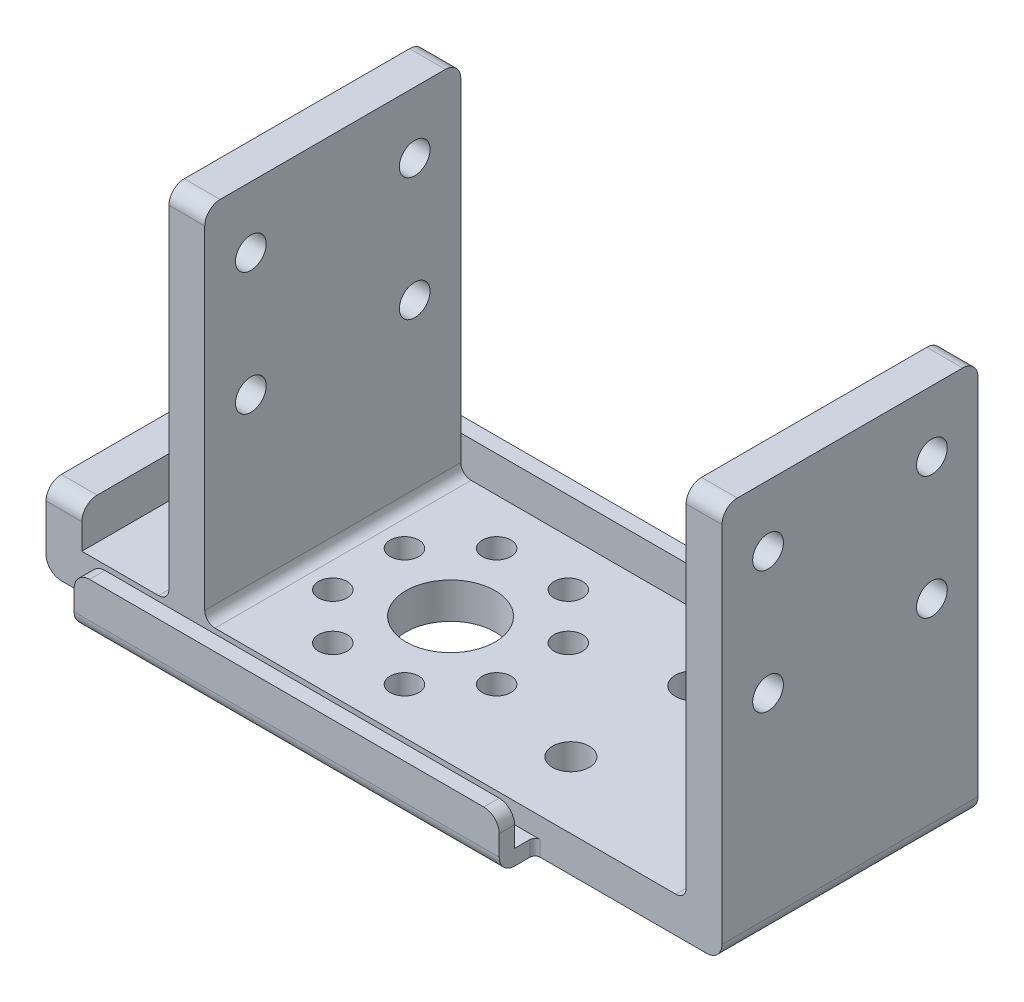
ISO-10303-21;
HEADER;
FILE_DESCRIPTION(('STEP AP214'),'2;1');
FILE_NAME('part.step','',(''),(''),'','','');
FILE_SCHEMA(('AUTOMOTIVE_DESIGN { 1 0 10303 214 1 1 1 1 }'));
ENDSEC;
DATA;
#1=APPLICATION_CONTEXT('core data for automotive mechanical design processes');
#2=APPLICATION_PROTOCOL_DEFINITION('international standard','automotive_design',2000,#1);
#3=PRODUCT_CONTEXT('',#1,'mechanical');
#4=PRODUCT('Part','Part','',(#3));
#5=PRODUCT_RELATED_PRODUCT_CATEGORY('part','',(#4));
#6=PRODUCT_DEFINITION_FORMATION('','',#4);
#7=PRODUCT_DEFINITION_CONTEXT('part definition',#1,'design');
#8=PRODUCT_DEFINITION('design','',#6,#7);
#9=PRODUCT_DEFINITION_SHAPE('','',#8);
#10=(LENGTH_UNIT() NAMED_UNIT(*) SI_UNIT(.MILLI.,.METRE.));
#11=(NAMED_UNIT(*) PLANE_ANGLE_UNIT() SI_UNIT($,.RADIAN.));
#12=(NAMED_UNIT(*) SI_UNIT($,.STERADIAN.) SOLID_ANGLE_UNIT());
#13=UNCERTAINTY_MEASURE_WITH_UNIT(LENGTH_MEASURE(1.E-05),#10,'distance_accuracy_value','');
#14=(GEOMETRIC_REPRESENTATION_CONTEXT(3) GLOBAL_UNCERTAINTY_ASSIGNED_CONTEXT((#13)) GLOBAL_UNIT_ASSIGNED_CONTEXT((#10,
#11,#12)) REPRESENTATION_CONTEXT('',''));
#15=CARTESIAN_POINT('',(0.,0.,0.));
#16=DIRECTION('',(0.,0.,1.));
#17=DIRECTION('',(1.,0.,0.));
#18=AXIS2_PLACEMENT_3D('',#15,#16,#17);
#19=CARTESIAN_POINT('',(-17.75,3.5,6.));
#20=DIRECTION('',(0.,-1.,0.));
#21=DIRECTION('',(0.,0.,-1.));
#22=AXIS2_PLACEMENT_3D('',#19,#20,#21);
#23=PLANE('',#22);
#24=DIRECTION('',(0.,0.,-1.));
#25=VECTOR('',#24,1.);
#26=CARTESIAN_POINT('',(-16.,3.5,0.));
#27=LINE('',#26,#25);
#28=CARTESIAN_POINT('',(-16.,3.5,6.4213074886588));
#29=VERTEX_POINT('',#28);
#30=CARTESIAN_POINT('',(-16.,3.5,5.5786925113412));
#31=VERTEX_POINT('',#30);
#32=EDGE_CURVE('E551',#29,#31,#27,.T.);
#33=ORIENTED_EDGE('',*,*,#32,.T.);
#34=CARTESIAN_POINT('',(-17.75,3.5,6.));
#35=DIRECTION('',(0.,1.,0.));
#36=DIRECTION('',(0.,0.,-1.));
#37=AXIS2_PLACEMENT_3D('',#34,#35,#36);
#38=CIRCLE('',#37,1.8);
#39=EDGE_CURVE('E11',#29,#31,#38,.T.);
#40=ORIENTED_EDGE('',*,*,#39,.F.);
#41=EDGE_LOOP('',(#33,#40));
#42=FACE_BOUND('',#41,.T.);
#43=ADVANCED_FACE('F17',(#42),#23,.T.);
#44=CARTESIAN_POINT('',(-17.75,3.5,-6.));
#45=DIRECTION('',(0.,1.,0.));
#46=DIRECTION('',(1.,0.,0.));
#47=AXIS2_PLACEMENT_3D('',#44,#45,#46);
#48=PLANE('',#47);
#49=DIRECTION('',(0.,0.,-1.));
#50=VECTOR('',#49,1.);
#51=CARTESIAN_POINT('',(-16.,3.5,0.));
#52=LINE('',#51,#50);
#53=CARTESIAN_POINT('',(-16.,3.5,-5.5786925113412));
#54=VERTEX_POINT('',#53);
#55=CARTESIAN_POINT('',(-16.,3.5,-6.4213074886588));
#56=VERTEX_POINT('',#55);
#57=EDGE_CURVE('E925',#54,#56,#52,.T.);
#58=ORIENTED_EDGE('',*,*,#57,.T.);
#59=CARTESIAN_POINT('',(-17.75,3.5,-6.));
#60=DIRECTION('',(0.,1.,0.));
#61=DIRECTION('',(0.,0.,1.));
#62=AXIS2_PLACEMENT_3D('',#59,#60,#61);
#63=CIRCLE('',#62,1.8);
#64=EDGE_CURVE('E25',#54,#56,#63,.T.);
#65=ORIENTED_EDGE('',*,*,#64,.F.);
#66=EDGE_LOOP('',(#58,#65));
#67=FACE_BOUND('',#66,.T.);
#68=ADVANCED_FACE('F2083',(#67),#48,.F.);
#69=CARTESIAN_POINT('',(-16.,4.5,0.));
#70=DIRECTION('',(0.,0.,1.));
#71=DIRECTION('',(1.,0.,0.));
#72=AXIS2_PLACEMENT_3D('',#69,#70,#71);
#73=CYLINDRICAL_SURFACE('',#72,1.);
#74=CARTESIAN_POINT('',(-16.,4.5,12.5));
#75=DIRECTION('',(0.,0.,-1.));
#76=DIRECTION('',(-1.,0.,0.));
#77=AXIS2_PLACEMENT_3D('',#74,#75,#76);
#78=CIRCLE('',#77,1.);
#79=CARTESIAN_POINT('',(-15.,4.5,12.5));
#80=VERTEX_POINT('',#79);
#81=CARTESIAN_POINT('',(-16.,3.5,12.5));
#82=VERTEX_POINT('',#81);
#83=EDGE_CURVE('E686',#80,#82,#78,.T.);
#84=ORIENTED_EDGE('',*,*,#83,.F.);
#85=DIRECTION('',(0.,0.,1.));
#86=VECTOR('',#85,1.);
#87=CARTESIAN_POINT('',(-15.,4.5,12.5));
#88=LINE('',#87,#86);
#89=CARTESIAN_POINT('',(-15.,4.5,-12.5));
#90=VERTEX_POINT('',#89);
#91=EDGE_CURVE('E1009',#90,#80,#88,.T.);
#92=ORIENTED_EDGE('',*,*,#91,.F.);
#93=CARTESIAN_POINT('',(-16.,4.5,-12.5));
#94=DIRECTION('',(0.,0.,1.));
#95=DIRECTION('',(1.,0.,0.));
#96=AXIS2_PLACEMENT_3D('',#93,#94,#95);
#97=CIRCLE('',#96,1.);
#98=CARTESIAN_POINT('',(-16.,3.5,-12.5));
#99=VERTEX_POINT('',#98);
#100=EDGE_CURVE('E610',#99,#90,#97,.T.);
#101=ORIENTED_EDGE('',*,*,#100,.F.);
#102=DIRECTION('',(0.,0.,-1.));
#103=VECTOR('',#102,1.);
#104=CARTESIAN_POINT('',(-16.,3.5,-12.5));
#105=LINE('',#104,#103);
#106=EDGE_CURVE('E789',#56,#99,#105,.T.);
#107=ORIENTED_EDGE('',*,*,#106,.F.);
#108=ORIENTED_EDGE('',*,*,#57,.F.);
#109=DIRECTION('',(0.,0.,-1.));
#110=VECTOR('',#109,1.);
#111=CARTESIAN_POINT('',(-16.,3.5,-12.5));
#112=LINE('',#111,#110);
#113=EDGE_CURVE('E785',#31,#54,#112,.T.);
#114=ORIENTED_EDGE('',*,*,#113,.F.);
#115=ORIENTED_EDGE('',*,*,#32,.F.);
#116=DIRECTION('',(0.,0.,-1.));
#117=VECTOR('',#116,1.);
#118=CARTESIAN_POINT('',(-16.,3.5,-12.5));
#119=LINE('',#118,#117);
#120=EDGE_CURVE('E781',#82,#29,#119,.T.);
#121=ORIENTED_EDGE('',*,*,#120,.F.);
#122=EDGE_LOOP('',(#84,#92,#101,#107,#108,#114,#115,#121));
#123=FACE_BOUND('',#122,.T.);
#124=ADVANCED_FACE('F1046',(#123),#73,.F.);
#125=CARTESIAN_POINT('',(-10.5,4.5,11.));
#126=DIRECTION('',(0.,0.,-1.));
#127=DIRECTION('',(-1.,0.,0.));
#128=AXIS2_PLACEMENT_3D('',#125,#126,#127);
#129=CYLINDRICAL_SURFACE('',#128,1.);
#130=CARTESIAN_POINT('',(-10.5,4.5,12.5));
#131=DIRECTION('',(0.,0.,-1.));
#132=DIRECTION('',(-1.,0.,0.));
#133=AXIS2_PLACEMENT_3D('',#130,#131,#132);
#134=CIRCLE('',#133,1.);
#135=CARTESIAN_POINT('',(-10.5,3.5,12.5));
#136=VERTEX_POINT('',#135);
#137=CARTESIAN_POINT('',(-11.5,4.5,12.5));
#138=VERTEX_POINT('',#137);
#139=EDGE_CURVE('E479',#136,#138,#134,.T.);
#140=ORIENTED_EDGE('',*,*,#139,.F.);
#141=DIRECTION('',(0.,0.,1.));
#142=VECTOR('',#141,1.);
#143=CARTESIAN_POINT('',(-10.5,3.5,0.));
#144=LINE('',#143,#142);
#145=CARTESIAN_POINT('',(-10.5,3.5,-12.5));
#146=VERTEX_POINT('',#145);
#147=EDGE_CURVE('E511',#146,#136,#144,.T.);
#148=ORIENTED_EDGE('',*,*,#147,.F.);
#149=CARTESIAN_POINT('',(-10.5,4.5,-12.5));
#150=DIRECTION('',(0.,0.,1.));
#151=DIRECTION('',(1.,0.,0.));
#152=AXIS2_PLACEMENT_3D('',#149,#150,#151);
#153=CIRCLE('',#152,1.);
#154=CARTESIAN_POINT('',(-11.5,4.5,-12.5));
#155=VERTEX_POINT('',#154);
#156=EDGE_CURVE('E702',#155,#146,#153,.T.);
#157=ORIENTED_EDGE('',*,*,#156,.F.);
#158=DIRECTION('',(0.,0.,-1.));
#159=VECTOR('',#158,1.);
#160=CARTESIAN_POINT('',(-11.5,4.5,11.));
#161=LINE('',#160,#159);
#162=EDGE_CURVE('E1012',#138,#155,#161,.T.);
#163=ORIENTED_EDGE('',*,*,#162,.F.);
#164=EDGE_LOOP('',(#140,#148,#157,#163));
#165=FACE_BOUND('',#164,.T.);
#166=ADVANCED_FACE('F1184',(#165),#129,.F.);
#167=CARTESIAN_POINT('',(34.5,4.5,11.));
#168=DIRECTION('',(0.,0.,1.));
#169=DIRECTION('',(1.,0.,0.));
#170=AXIS2_PLACEMENT_3D('',#167,#168,#169);
#171=CYLINDRICAL_SURFACE('',#170,1.);
#172=CARTESIAN_POINT('',(34.5,4.5,-12.5));
#173=DIRECTION('',(0.,0.,1.));
#174=DIRECTION('',(1.,0.,0.));
#175=AXIS2_PLACEMENT_3D('',#172,#173,#174);
#176=CIRCLE('',#175,1.);
#177=CARTESIAN_POINT('',(34.5,3.5,-12.5));
#178=VERTEX_POINT('',#177);
#179=CARTESIAN_POINT('',(35.5,4.5,-12.5));
#180=VERTEX_POINT('',#179);
#181=EDGE_CURVE('E443',#178,#180,#176,.T.);
#182=ORIENTED_EDGE('',*,*,#181,.F.);
#183=DIRECTION('',(0.,0.,-1.));
#184=VECTOR('',#183,1.);
#185=CARTESIAN_POINT('',(34.5,3.5,0.));
#186=LINE('',#185,#184);
#187=CARTESIAN_POINT('',(34.5,3.5,12.5));
#188=VERTEX_POINT('',#187);
#189=EDGE_CURVE('E515',#188,#178,#186,.T.);
#190=ORIENTED_EDGE('',*,*,#189,.F.);
#191=CARTESIAN_POINT('',(34.5,4.5,12.5));
#192=DIRECTION('',(0.,0.,-1.));
#193=DIRECTION('',(-1.,0.,0.));
#194=AXIS2_PLACEMENT_3D('',#191,#192,#193);
#195=CIRCLE('',#194,1.);
#196=CARTESIAN_POINT('',(35.5,4.5,12.5));
#197=VERTEX_POINT('',#196);
#198=EDGE_CURVE('E623',#197,#188,#195,.T.);
#199=ORIENTED_EDGE('',*,*,#198,.F.);
#200=DIRECTION('',(0.,0.,1.));
#201=VECTOR('',#200,1.);
#202=CARTESIAN_POINT('',(35.5,4.5,11.));
#203=LINE('',#202,#201);
#204=EDGE_CURVE('E1028',#180,#197,#203,.T.);
#205=ORIENTED_EDGE('',*,*,#204,.F.);
#206=EDGE_LOOP('',(#182,#190,#199,#205));
#207=FACE_BOUND('',#206,.T.);
#208=ADVANCED_FACE('F1180',(#207),#171,.F.);
#209=CARTESIAN_POINT('',(0.,6.,11.));
#210=DIRECTION('',(-1.,0.,0.));
#211=DIRECTION('',(0.,0.,1.));
#212=AXIS2_PLACEMENT_3D('',#209,#210,#211);
#213=CYLINDRICAL_SURFACE('',#212,1.5);
#214=CARTESIAN_POINT('',(-27.,6.,11.));
#215=DIRECTION('',(-1.,0.,0.));
#216=DIRECTION('',(0.,0.,1.));
#217=AXIS2_PLACEMENT_3D('',#214,#215,#216);
#218=CIRCLE('',#217,1.5);
#219=CARTESIAN_POINT('',(-27.,6.,12.5));
#220=VERTEX_POINT('',#219);
#221=CARTESIAN_POINT('',(-27.,7.5,11.));
#222=VERTEX_POINT('',#221);
#223=EDGE_CURVE('E777',#220,#222,#218,.T.);
#224=ORIENTED_EDGE('',*,*,#223,.F.);
#225=DIRECTION('',(-1.,0.,0.));
#226=VECTOR('',#225,1.);
#227=CARTESIAN_POINT('',(-27.,6.,12.5));
#228=LINE('',#227,#226);
#229=CARTESIAN_POINT('',(-23.5,6.,12.5));
#230=VERTEX_POINT('',#229);
#231=EDGE_CURVE('E645',#230,#220,#228,.T.);
#232=ORIENTED_EDGE('',*,*,#231,.F.);
#233=CARTESIAN_POINT('',(-23.5,6.,11.));
#234=DIRECTION('',(1.,0.,0.));
#235=DIRECTION('',(0.,0.,1.));
#236=AXIS2_PLACEMENT_3D('',#233,#234,#235);
#237=CIRCLE('',#236,1.5);
#238=CARTESIAN_POINT('',(-23.5,7.5,11.));
#239=VERTEX_POINT('',#238);
#240=EDGE_CURVE('E766',#239,#230,#237,.T.);
#241=ORIENTED_EDGE('',*,*,#240,.F.);
#242=DIRECTION('',(1.,0.,0.));
#243=VECTOR('',#242,1.);
#244=CARTESIAN_POINT('',(-23.5,7.5,11.));
#245=LINE('',#244,#243);
#246=EDGE_CURVE('E929',#222,#239,#245,.T.);
#247=ORIENTED_EDGE('',*,*,#246,.F.);
#248=EDGE_LOOP('',(#224,#232,#241,#247));
#249=FACE_BOUND('',#248,.T.);
#250=ADVANCED_FACE('F2233',(#249),#213,.T.);
#251=CARTESIAN_POINT('',(0.,6.,-11.));
#252=DIRECTION('',(1.,0.,0.));
#253=DIRECTION('',(0.,0.,-1.));
#254=AXIS2_PLACEMENT_3D('',#251,#252,#253);
#255=CYLINDRICAL_SURFACE('',#254,1.5);
#256=CARTESIAN_POINT('',(-23.5,6.,-11.));
#257=DIRECTION('',(1.,0.,0.));
#258=DIRECTION('',(0.,0.,1.));
#259=AXIS2_PLACEMENT_3D('',#256,#257,#258);
#260=CIRCLE('',#259,1.5);
#261=CARTESIAN_POINT('',(-23.5,6.,-12.5));
#262=VERTEX_POINT('',#261);
#263=CARTESIAN_POINT('',(-23.5,7.5,-11.));
#264=VERTEX_POINT('',#263);
#265=EDGE_CURVE('E761',#262,#264,#260,.T.);
#266=ORIENTED_EDGE('',*,*,#265,.F.);
#267=DIRECTION('',(1.,0.,0.));
#268=VECTOR('',#267,1.);
#269=CARTESIAN_POINT('',(-23.5,6.,-12.5));
#270=LINE('',#269,#268);
#271=CARTESIAN_POINT('',(-27.,6.,-12.5));
#272=VERTEX_POINT('',#271);
#273=EDGE_CURVE('E477',#272,#262,#270,.T.);
#274=ORIENTED_EDGE('',*,*,#273,.F.);
#275=CARTESIAN_POINT('',(-27.,6.,-11.));
#276=DIRECTION('',(-1.,0.,0.));
#277=DIRECTION('',(0.,0.,1.));
#278=AXIS2_PLACEMENT_3D('',#275,#276,#277);
#279=CIRCLE('',#278,1.5);
#280=CARTESIAN_POINT('',(-27.,7.5,-11.));
#281=VERTEX_POINT('',#280);
#282=EDGE_CURVE('E711',#281,#272,#279,.T.);
#283=ORIENTED_EDGE('',*,*,#282,.F.);
#284=DIRECTION('',(-1.,0.,0.));
#285=VECTOR('',#284,1.);
#286=CARTESIAN_POINT('',(-27.,7.5,-11.));
#287=LINE('',#286,#285);
#288=EDGE_CURVE('E1031',#264,#281,#287,.T.);
#289=ORIENTED_EDGE('',*,*,#288,.F.);
#290=EDGE_LOOP('',(#266,#274,#283,#289));
#291=FACE_BOUND('',#290,.T.);
#292=ADVANCED_FACE('F2228',(#291),#255,.T.);
#293=CARTESIAN_POINT('',(0.,7.5,0.));
#294=DIRECTION('',(0.,1.,0.));
#295=DIRECTION('',(1.,0.,0.));
#296=AXIS2_PLACEMENT_3D('',#293,#294,#295);
#297=PLANE('',#296);
#298=DIRECTION('',(0.,0.,-1.));
#299=VECTOR('',#298,1.);
#300=CARTESIAN_POINT('',(-23.5,7.5,12.5));
#301=LINE('',#300,#299);
#302=EDGE_CURVE('E762',#239,#264,#301,.T.);
#303=ORIENTED_EDGE('',*,*,#302,.T.);
#304=ORIENTED_EDGE('',*,*,#288,.T.);
#305=DIRECTION('',(0.,0.,1.));
#306=VECTOR('',#305,1.);
#307=CARTESIAN_POINT('',(-27.,7.5,-12.5));
#308=LINE('',#307,#306);
#309=EDGE_CURVE('E715',#281,#222,#308,.T.);
#310=ORIENTED_EDGE('',*,*,#309,.T.);
#311=ORIENTED_EDGE('',*,*,#246,.T.);
#312=EDGE_LOOP('',(#303,#304,#310,#311));
#313=FACE_BOUND('',#312,.T.);
#314=ADVANCED_FACE('F2232',(#313),#297,.T.);
#315=CARTESIAN_POINT('',(35.5,37.,11.));
#316=DIRECTION('',(-1.,0.,0.));
#317=DIRECTION('',(0.,0.,1.));
#318=AXIS2_PLACEMENT_3D('',#315,#316,#317);
#319=PLANE('',#318);
#320=CARTESIAN_POINT('',(35.5,32.5,8.));
#321=DIRECTION('',(-1.,0.,0.));
#322=DIRECTION('',(0.,0.,1.));
#323=AXIS2_PLACEMENT_3D('',#320,#321,#322);
#324=CIRCLE('',#323,1.5);
#325=CARTESIAN_POINT('',(35.5,32.5,9.5));
#326=VERTEX_POINT('',#325);
#327=EDGE_CURVE('E539',#326,#326,#324,.T.);
#328=ORIENTED_EDGE('',*,*,#327,.F.);
#329=EDGE_LOOP('',(#328));
#330=FACE_BOUND('',#329,.T.);
#331=CARTESIAN_POINT('',(35.5,20.5,-8.));
#332=DIRECTION('',(-1.,0.,0.));
#333=DIRECTION('',(0.,0.,1.));
#334=AXIS2_PLACEMENT_3D('',#331,#332,#333);
#335=CIRCLE('',#334,1.5);
#336=CARTESIAN_POINT('',(35.5,20.5,-6.5));
#337=VERTEX_POINT('',#336);
#338=EDGE_CURVE('E658',#337,#337,#335,.T.);
#339=ORIENTED_EDGE('',*,*,#338,.F.);
#340=EDGE_LOOP('',(#339));
#341=FACE_BOUND('',#340,.T.);
#342=CARTESIAN_POINT('',(35.5,20.5,8.));
#343=DIRECTION('',(-1.,0.,0.));
#344=DIRECTION('',(0.,0.,1.));
#345=AXIS2_PLACEMENT_3D('',#342,#343,#344);
#346=CIRCLE('',#345,1.5);
#347=CARTESIAN_POINT('',(35.5,20.5,9.5));
#348=VERTEX_POINT('',#347);
#349=EDGE_CURVE('E520',#348,#348,#346,.T.);
#350=ORIENTED_EDGE('',*,*,#349,.F.);
#351=EDGE_LOOP('',(#350));
#352=FACE_BOUND('',#351,.T.);
#353=CARTESIAN_POINT('',(35.5,32.5,-8.));
#354=DIRECTION('',(-1.,0.,0.));
#355=DIRECTION('',(0.,0.,1.));
#356=AXIS2_PLACEMENT_3D('',#353,#354,#355);
#357=CIRCLE('',#356,1.5);
#358=CARTESIAN_POINT('',(35.5,32.5,-6.5));
#359=VERTEX_POINT('',#358);
#360=EDGE_CURVE('E521',#359,#359,#357,.T.);
#361=ORIENTED_EDGE('',*,*,#360,.F.);
#362=EDGE_LOOP('',(#361));
#363=FACE_BOUND('',#362,.T.);
#364=DIRECTION('',(0.,-1.,0.));
#365=VECTOR('',#364,1.);
#366=CARTESIAN_POINT('',(35.5,37.,-12.5));
#367=LINE('',#366,#365);
#368=CARTESIAN_POINT('',(35.5,37.,-12.5));
#369=VERTEX_POINT('',#368);
#370=EDGE_CURVE('E421',#369,#180,#367,.T.);
#371=ORIENTED_EDGE('',*,*,#370,.T.);
#372=ORIENTED_EDGE('',*,*,#204,.T.);
#373=DIRECTION('',(0.,1.,0.));
#374=VECTOR('',#373,1.);
#375=CARTESIAN_POINT('',(35.5,3.5,12.5));
#376=LINE('',#375,#374);
#377=CARTESIAN_POINT('',(35.5,37.,12.5));
#378=VERTEX_POINT('',#377);
#379=EDGE_CURVE('E620',#197,#378,#376,.T.);
#380=ORIENTED_EDGE('',*,*,#379,.T.);
#381=CARTESIAN_POINT('',(35.5,37.,11.));
#382=DIRECTION('',(-1.,0.,0.));
#383=DIRECTION('',(0.,0.,1.));
#384=AXIS2_PLACEMENT_3D('',#381,#382,#383);
#385=CIRCLE('',#384,1.5);
#386=CARTESIAN_POINT('',(35.5,38.5,11.));
#387=VERTEX_POINT('',#386);
#388=EDGE_CURVE('E38',#378,#387,#385,.T.);
#389=ORIENTED_EDGE('',*,*,#388,.T.);
#390=DIRECTION('',(0.,0.,-1.));
#391=VECTOR('',#390,1.);
#392=CARTESIAN_POINT('',(35.5,38.5,11.));
#393=LINE('',#392,#391);
#394=CARTESIAN_POINT('',(35.5,38.5,-11.));
#395=VERTEX_POINT('',#394);
#396=EDGE_CURVE('E46',#387,#395,#393,.T.);
#397=ORIENTED_EDGE('',*,*,#396,.T.);
#398=CARTESIAN_POINT('',(35.5,37.,-11.));
#399=DIRECTION('',(-1.,0.,0.));
#400=DIRECTION('',(0.,0.,1.));
#401=AXIS2_PLACEMENT_3D('',#398,#399,#400);
#402=CIRCLE('',#401,1.5);
#403=EDGE_CURVE('E417',#395,#369,#402,.T.);
#404=ORIENTED_EDGE('',*,*,#403,.T.);
#405=EDGE_LOOP('',(#371,#372,#380,#389,#397,#404));
#406=FACE_BOUND('',#405,.T.);
#407=ADVANCED_FACE('F419',(#330,#341,#352,#363,#406),#319,.T.);
#408=CARTESIAN_POINT('',(39.,37.,11.));
#409=DIRECTION('',(-1.,0.,0.));
#410=DIRECTION('',(0.,0.,1.));
#411=AXIS2_PLACEMENT_3D('',#408,#409,#410);
#412=CYLINDRICAL_SURFACE('',#411,1.5);
#413=ORIENTED_EDGE('',*,*,#388,.F.);
#414=DIRECTION('',(-1.,0.,0.));
#415=VECTOR('',#414,1.);
#416=CARTESIAN_POINT('',(39.,37.,12.5));
#417=LINE('',#416,#415);
#418=CARTESIAN_POINT('',(39.,37.,12.5));
#419=VERTEX_POINT('',#418);
#420=EDGE_CURVE('E624',#419,#378,#417,.T.);
#421=ORIENTED_EDGE('',*,*,#420,.F.);
#422=CARTESIAN_POINT('',(39.,37.,11.));
#423=DIRECTION('',(-1.,0.,0.));
#424=DIRECTION('',(0.,0.,1.));
#425=AXIS2_PLACEMENT_3D('',#422,#423,#424);
#426=CIRCLE('',#425,1.5);
#427=CARTESIAN_POINT('',(39.,38.5,11.));
#428=VERTEX_POINT('',#427);
#429=EDGE_CURVE('E794',#419,#428,#426,.T.);
#430=ORIENTED_EDGE('',*,*,#429,.T.);
#431=DIRECTION('',(-1.,0.,0.));
#432=VECTOR('',#431,1.);
#433=CARTESIAN_POINT('',(39.,38.5,11.));
#434=LINE('',#433,#432);
#435=EDGE_CURVE('E942',#428,#387,#434,.T.);
#436=ORIENTED_EDGE('',*,*,#435,.T.);
#437=EDGE_LOOP('',(#413,#421,#430,#436));
#438=FACE_BOUND('',#437,.T.);
#439=ADVANCED_FACE('F2292',(#438),#412,.T.);
#440=CARTESIAN_POINT('',(39.,38.5,11.));
#441=DIRECTION('',(0.,1.,0.));
#442=DIRECTION('',(1.,0.,0.));
#443=AXIS2_PLACEMENT_3D('',#440,#441,#442);
#444=PLANE('',#443);
#445=ORIENTED_EDGE('',*,*,#396,.F.);
#446=ORIENTED_EDGE('',*,*,#435,.F.);
#447=DIRECTION('',(0.,0.,-1.));
#448=VECTOR('',#447,1.);
#449=CARTESIAN_POINT('',(39.,38.5,11.));
#450=LINE('',#449,#448);
#451=CARTESIAN_POINT('',(39.,38.5,-11.));
#452=VERTEX_POINT('',#451);
#453=EDGE_CURVE('E790',#428,#452,#450,.T.);
#454=ORIENTED_EDGE('',*,*,#453,.T.);
#455=DIRECTION('',(-1.,0.,0.));
#456=VECTOR('',#455,1.);
#457=CARTESIAN_POINT('',(39.,38.5,-11.));
#458=LINE('',#457,#456);
#459=EDGE_CURVE('E425',#452,#395,#458,.T.);
#460=ORIENTED_EDGE('',*,*,#459,.T.);
#461=EDGE_LOOP('',(#445,#446,#454,#460));
#462=FACE_BOUND('',#461,.T.);
#463=ADVANCED_FACE('F2284',(#462),#444,.T.);
#464=CARTESIAN_POINT('',(39.,37.,-11.));
#465=DIRECTION('',(-1.,0.,0.));
#466=DIRECTION('',(0.,0.,1.));
#467=AXIS2_PLACEMENT_3D('',#464,#465,#466);
#468=CYLINDRICAL_SURFACE('',#467,1.5);
#469=ORIENTED_EDGE('',*,*,#403,.F.);
#470=ORIENTED_EDGE('',*,*,#459,.F.);
#471=CARTESIAN_POINT('',(39.,37.,-11.));
#472=DIRECTION('',(-1.,0.,0.));
#473=DIRECTION('',(0.,0.,1.));
#474=AXIS2_PLACEMENT_3D('',#471,#472,#473);
#475=CIRCLE('',#474,1.5);
#476=CARTESIAN_POINT('',(39.,37.,-12.5));
#477=VERTEX_POINT('',#476);
#478=EDGE_CURVE('E432',#452,#477,#475,.T.);
#479=ORIENTED_EDGE('',*,*,#478,.T.);
#480=DIRECTION('',(-1.,0.,0.));
#481=VECTOR('',#480,1.);
#482=CARTESIAN_POINT('',(39.,37.,-12.5));
#483=LINE('',#482,#481);
#484=EDGE_CURVE('E429',#477,#369,#483,.T.);
#485=ORIENTED_EDGE('',*,*,#484,.T.);
#486=EDGE_LOOP('',(#469,#470,#479,#485));
#487=FACE_BOUND('',#486,.T.);
#488=ADVANCED_FACE('F430',(#487),#468,.T.);
#489=CARTESIAN_POINT('',(37.5,1.5,28.3902485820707));
#490=DIRECTION('',(0.,0.,-1.));
#491=DIRECTION('',(-1.,0.,0.));
#492=AXIS2_PLACEMENT_3D('',#489,#490,#491);
#493=CYLINDRICAL_SURFACE('',#492,1.5);
#494=DIRECTION('',(0.,0.,-1.));
#495=VECTOR('',#494,1.);
#496=CARTESIAN_POINT('',(39.,1.5,28.3902485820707));
#497=LINE('',#496,#495);
#498=CARTESIAN_POINT('',(39.,1.5,12.5));
#499=VERTEX_POINT('',#498);
#500=CARTESIAN_POINT('',(39.,1.5,-12.5));
#501=VERTEX_POINT('',#500);
#502=EDGE_CURVE('E426',#499,#501,#497,.T.);
#503=ORIENTED_EDGE('',*,*,#502,.F.);
#504=CARTESIAN_POINT('',(37.5,1.5,12.5));
#505=DIRECTION('',(0.,0.,-1.));
#506=DIRECTION('',(1.,0.,0.));
#507=AXIS2_PLACEMENT_3D('',#504,#505,#506);
#508=CIRCLE('',#507,1.5);
#509=CARTESIAN_POINT('',(37.5,0.,12.5));
#510=VERTEX_POINT('',#509);
#511=EDGE_CURVE('E674',#499,#510,#508,.T.);
#512=ORIENTED_EDGE('',*,*,#511,.T.);
#513=DIRECTION('',(0.,0.,-1.));
#514=VECTOR('',#513,1.);
#515=CARTESIAN_POINT('',(37.5,0.,28.3902485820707));
#516=LINE('',#515,#514);
#517=CARTESIAN_POINT('',(37.5,0.,-12.5));
#518=VERTEX_POINT('',#517);
#519=EDGE_CURVE('E827',#510,#518,#516,.T.);
#520=ORIENTED_EDGE('',*,*,#519,.T.);
#521=CARTESIAN_POINT('',(37.5,1.5,-12.5));
#522=DIRECTION('',(0.,0.,-1.));
#523=DIRECTION('',(-1.,0.,0.));
#524=AXIS2_PLACEMENT_3D('',#521,#522,#523);
#525=CIRCLE('',#524,1.5);
#526=EDGE_CURVE('E468',#501,#518,#525,.T.);
#527=ORIENTED_EDGE('',*,*,#526,.F.);
#528=EDGE_LOOP('',(#503,#512,#520,#527));
#529=FACE_BOUND('',#528,.T.);
#530=ADVANCED_FACE('F2041',(#529),#493,.T.);
#531=CARTESIAN_POINT('',(39.,3.5,28.3902485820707));
#532=DIRECTION('',(1.,0.,0.));
#533=DIRECTION('',(0.,1.,0.));
#534=AXIS2_PLACEMENT_3D('',#531,#532,#533);
#535=PLANE('',#534);
#536=CARTESIAN_POINT('',(39.,32.5,8.));
#537=DIRECTION('',(1.,0.,0.));
#538=DIRECTION('',(0.,0.,-1.));
#539=AXIS2_PLACEMENT_3D('',#536,#537,#538);
#540=CIRCLE('',#539,1.5);
#541=CARTESIAN_POINT('',(39.,32.5,6.5));
#542=VERTEX_POINT('',#541);
#543=EDGE_CURVE('E478',#542,#542,#540,.T.);
#544=ORIENTED_EDGE('',*,*,#543,.F.);
#545=EDGE_LOOP('',(#544));
#546=FACE_BOUND('',#545,.T.);
#547=CARTESIAN_POINT('',(39.,20.5,-8.));
#548=DIRECTION('',(1.,0.,0.));
#549=DIRECTION('',(0.,0.,-1.));
#550=AXIS2_PLACEMENT_3D('',#547,#548,#549);
#551=CIRCLE('',#550,1.5);
#552=CARTESIAN_POINT('',(39.,20.5,-9.5));
#553=VERTEX_POINT('',#552);
#554=EDGE_CURVE('E636',#553,#553,#551,.T.);
#555=ORIENTED_EDGE('',*,*,#554,.F.);
#556=EDGE_LOOP('',(#555));
#557=FACE_BOUND('',#556,.T.);
#558=CARTESIAN_POINT('',(39.,20.5,8.));
#559=DIRECTION('',(1.,0.,0.));
#560=DIRECTION('',(0.,0.,-1.));
#561=AXIS2_PLACEMENT_3D('',#558,#559,#560);
#562=CIRCLE('',#561,1.5);
#563=CARTESIAN_POINT('',(39.,20.5,6.5));
#564=VERTEX_POINT('',#563);
#565=EDGE_CURVE('E455',#564,#564,#562,.T.);
#566=ORIENTED_EDGE('',*,*,#565,.F.);
#567=EDGE_LOOP('',(#566));
#568=FACE_BOUND('',#567,.T.);
#569=CARTESIAN_POINT('',(39.,32.5,-8.));
#570=DIRECTION('',(1.,0.,0.));
#571=DIRECTION('',(0.,0.,-1.));
#572=AXIS2_PLACEMENT_3D('',#569,#570,#571);
#573=CIRCLE('',#572,1.5);
#574=CARTESIAN_POINT('',(39.,32.5,-9.5));
#575=VERTEX_POINT('',#574);
#576=EDGE_CURVE('E516',#575,#575,#573,.T.);
#577=ORIENTED_EDGE('',*,*,#576,.F.);
#578=EDGE_LOOP('',(#577));
#579=FACE_BOUND('',#578,.T.);
#580=DIRECTION('',(0.,-1.,0.));
#581=VECTOR('',#580,1.);
#582=CARTESIAN_POINT('',(39.,3.5,-12.5));
#583=LINE('',#582,#581);
#584=EDGE_CURVE('E437',#477,#501,#583,.T.);
#585=ORIENTED_EDGE('',*,*,#584,.F.);
#586=ORIENTED_EDGE('',*,*,#478,.F.);
#587=ORIENTED_EDGE('',*,*,#453,.F.);
#588=ORIENTED_EDGE('',*,*,#429,.F.);
#589=DIRECTION('',(0.,-1.,0.));
#590=VECTOR('',#589,1.);
#591=CARTESIAN_POINT('',(39.,3.5,12.5));
#592=LINE('',#591,#590);
#593=EDGE_CURVE('E678',#419,#499,#592,.T.);
#594=ORIENTED_EDGE('',*,*,#593,.T.);
#595=ORIENTED_EDGE('',*,*,#502,.T.);
#596=EDGE_LOOP('',(#585,#586,#587,#588,#594,#595));
#597=FACE_BOUND('',#596,.T.);
#598=ADVANCED_FACE('F2037',(#546,#557,#568,#579,#597),#535,.T.);
#599=CARTESIAN_POINT('',(-11.5,37.,11.));
#600=DIRECTION('',(1.,0.,0.));
#601=DIRECTION('',(0.,1.,0.));
#602=AXIS2_PLACEMENT_3D('',#599,#600,#601);
#603=PLANE('',#602);
#604=CARTESIAN_POINT('',(-11.5,32.5,8.));
#605=DIRECTION('',(1.,0.,0.));
#606=DIRECTION('',(0.,0.,-1.));
#607=AXIS2_PLACEMENT_3D('',#604,#605,#606);
#608=CIRCLE('',#607,1.5);
#609=CARTESIAN_POINT('',(-11.5,32.5,6.5));
#610=VERTEX_POINT('',#609);
#611=EDGE_CURVE('E657',#610,#610,#608,.T.);
#612=ORIENTED_EDGE('',*,*,#611,.F.);
#613=EDGE_LOOP('',(#612));
#614=FACE_BOUND('',#613,.T.);
#615=CARTESIAN_POINT('',(-11.5,20.5,-8.));
#616=DIRECTION('',(1.,0.,0.));
#617=DIRECTION('',(0.,0.,-1.));
#618=AXIS2_PLACEMENT_3D('',#615,#616,#617);
#619=CIRCLE('',#618,1.5);
#620=CARTESIAN_POINT('',(-11.5,20.5,-9.5));
#621=VERTEX_POINT('',#620);
#622=EDGE_CURVE('E649',#621,#621,#619,.T.);
#623=ORIENTED_EDGE('',*,*,#622,.F.);
#624=EDGE_LOOP('',(#623));
#625=FACE_BOUND('',#624,.T.);
#626=CARTESIAN_POINT('',(-11.5,20.5,8.));
#627=DIRECTION('',(1.,0.,0.));
#628=DIRECTION('',(0.,0.,-1.));
#629=AXIS2_PLACEMENT_3D('',#626,#627,#628);
#630=CIRCLE('',#629,1.5);
#631=CARTESIAN_POINT('',(-11.5,20.5,6.5));
#632=VERTEX_POINT('',#631);
#633=EDGE_CURVE('E628',#632,#632,#630,.T.);
#634=ORIENTED_EDGE('',*,*,#633,.F.);
#635=EDGE_LOOP('',(#634));
#636=FACE_BOUND('',#635,.T.);
#637=CARTESIAN_POINT('',(-11.5,32.5,-8.));
#638=DIRECTION('',(1.,0.,0.));
#639=DIRECTION('',(0.,0.,-1.));
#640=AXIS2_PLACEMENT_3D('',#637,#638,#639);
#641=CIRCLE('',#640,1.5);
#642=CARTESIAN_POINT('',(-11.5,32.5,-9.5));
#643=VERTEX_POINT('',#642);
#644=EDGE_CURVE('E605',#643,#643,#641,.T.);
#645=ORIENTED_EDGE('',*,*,#644,.F.);
#646=EDGE_LOOP('',(#645));
#647=FACE_BOUND('',#646,.T.);
#648=DIRECTION('',(0.,-1.,0.));
#649=VECTOR('',#648,1.);
#650=CARTESIAN_POINT('',(-11.5,37.,12.5));
#651=LINE('',#650,#649);
#652=CARTESIAN_POINT('',(-11.5,37.,12.5));
#653=VERTEX_POINT('',#652);
#654=EDGE_CURVE('E483',#653,#138,#651,.T.);
#655=ORIENTED_EDGE('',*,*,#654,.T.);
#656=ORIENTED_EDGE('',*,*,#162,.T.);
#657=DIRECTION('',(0.,1.,0.));
#658=VECTOR('',#657,1.);
#659=CARTESIAN_POINT('',(-11.5,3.5,-12.5));
#660=LINE('',#659,#658);
#661=CARTESIAN_POINT('',(-11.5,37.,-12.5));
#662=VERTEX_POINT('',#661);
#663=EDGE_CURVE('E698',#155,#662,#660,.T.);
#664=ORIENTED_EDGE('',*,*,#663,.T.);
#665=CARTESIAN_POINT('',(-11.5,37.,-11.));
#666=DIRECTION('',(1.,0.,0.));
#667=DIRECTION('',(0.,0.,-1.));
#668=AXIS2_PLACEMENT_3D('',#665,#666,#667);
#669=CIRCLE('',#668,1.5);
#670=CARTESIAN_POINT('',(-11.5,38.5,-11.));
#671=VERTEX_POINT('',#670);
#672=EDGE_CURVE('E1003',#662,#671,#669,.T.);
#673=ORIENTED_EDGE('',*,*,#672,.T.);
#674=DIRECTION('',(0.,0.,1.));
#675=VECTOR('',#674,1.);
#676=CARTESIAN_POINT('',(-11.5,38.5,-11.));
#677=LINE('',#676,#675);
#678=CARTESIAN_POINT('',(-11.5,38.5,11.));
#679=VERTEX_POINT('',#678);
#680=EDGE_CURVE('E993',#671,#679,#677,.T.);
#681=ORIENTED_EDGE('',*,*,#680,.T.);
#682=CARTESIAN_POINT('',(-11.5,37.,11.));
#683=DIRECTION('',(1.,0.,0.));
#684=DIRECTION('',(0.,0.,-1.));
#685=AXIS2_PLACEMENT_3D('',#682,#683,#684);
#686=CIRCLE('',#685,1.5);
#687=EDGE_CURVE('E983',#679,#653,#686,.T.);
#688=ORIENTED_EDGE('',*,*,#687,.T.);
#689=EDGE_LOOP('',(#655,#656,#664,#673,#681,#688));
#690=FACE_BOUND('',#689,.T.);
#691=ADVANCED_FACE('F1189',(#614,#625,#636,#647,#690),#603,.T.);
#692=CARTESIAN_POINT('',(-15.,37.,11.));
#693=DIRECTION('',(1.,0.,0.));
#694=DIRECTION('',(0.,1.,0.));
#695=AXIS2_PLACEMENT_3D('',#692,#693,#694);
#696=PLANE('',#695);
#697=CARTESIAN_POINT('',(-15.,32.5,8.));
#698=DIRECTION('',(1.,0.,0.));
#699=DIRECTION('',(0.,0.,-1.));
#700=AXIS2_PLACEMENT_3D('',#697,#698,#699);
#701=CIRCLE('',#700,1.5);
#702=CARTESIAN_POINT('',(-15.,32.5,6.5));
#703=VERTEX_POINT('',#702);
#704=EDGE_CURVE('E653',#703,#703,#701,.T.);
#705=ORIENTED_EDGE('',*,*,#704,.T.);
#706=EDGE_LOOP('',(#705));
#707=FACE_BOUND('',#706,.T.);
#708=CARTESIAN_POINT('',(-15.,20.5,-8.));
#709=DIRECTION('',(1.,0.,0.));
#710=DIRECTION('',(0.,0.,-1.));
#711=AXIS2_PLACEMENT_3D('',#708,#709,#710);
#712=CIRCLE('',#711,1.5);
#713=CARTESIAN_POINT('',(-15.,20.5,-9.5));
#714=VERTEX_POINT('',#713);
#715=EDGE_CURVE('E632',#714,#714,#712,.T.);
#716=ORIENTED_EDGE('',*,*,#715,.T.);
#717=EDGE_LOOP('',(#716));
#718=FACE_BOUND('',#717,.T.);
#719=CARTESIAN_POINT('',(-15.,20.5,8.));
#720=DIRECTION('',(1.,0.,0.));
#721=DIRECTION('',(0.,0.,-1.));
#722=AXIS2_PLACEMENT_3D('',#719,#720,#721);
#723=CIRCLE('',#722,1.5);
#724=CARTESIAN_POINT('',(-15.,20.5,6.5));
#725=VERTEX_POINT('',#724);
#726=EDGE_CURVE('E619',#725,#725,#723,.T.);
#727=ORIENTED_EDGE('',*,*,#726,.T.);
#728=EDGE_LOOP('',(#727));
#729=FACE_BOUND('',#728,.T.);
#730=CARTESIAN_POINT('',(-15.,32.5,-8.));
#731=DIRECTION('',(1.,0.,0.));
#732=DIRECTION('',(0.,0.,-1.));
#733=AXIS2_PLACEMENT_3D('',#730,#731,#732);
#734=CIRCLE('',#733,1.5);
#735=CARTESIAN_POINT('',(-15.,32.5,-9.5));
#736=VERTEX_POINT('',#735);
#737=EDGE_CURVE('E598',#736,#736,#734,.T.);
#738=ORIENTED_EDGE('',*,*,#737,.T.);
#739=EDGE_LOOP('',(#738));
#740=FACE_BOUND('',#739,.T.);
#741=DIRECTION('',(0.,1.,0.));
#742=VECTOR('',#741,1.);
#743=CARTESIAN_POINT('',(-15.,3.5,-12.5));
#744=LINE('',#743,#742);
#745=CARTESIAN_POINT('',(-15.,37.,-12.5));
#746=VERTEX_POINT('',#745);
#747=EDGE_CURVE('E614',#90,#746,#744,.T.);
#748=ORIENTED_EDGE('',*,*,#747,.F.);
#749=ORIENTED_EDGE('',*,*,#91,.T.);
#750=DIRECTION('',(0.,-1.,0.));
#751=VECTOR('',#750,1.);
#752=CARTESIAN_POINT('',(-15.,37.,12.5));
#753=LINE('',#752,#751);
#754=CARTESIAN_POINT('',(-15.,37.,12.5));
#755=VERTEX_POINT('',#754);
#756=EDGE_CURVE('E682',#755,#80,#753,.T.);
#757=ORIENTED_EDGE('',*,*,#756,.F.);
#758=CARTESIAN_POINT('',(-15.,37.,11.));
#759=DIRECTION('',(1.,0.,0.));
#760=DIRECTION('',(0.,0.,-1.));
#761=AXIS2_PLACEMENT_3D('',#758,#759,#760);
#762=CIRCLE('',#761,1.5);
#763=CARTESIAN_POINT('',(-15.,38.5,11.));
#764=VERTEX_POINT('',#763);
#765=EDGE_CURVE('E990',#764,#755,#762,.T.);
#766=ORIENTED_EDGE('',*,*,#765,.F.);
#767=DIRECTION('',(0.,0.,1.));
#768=VECTOR('',#767,1.);
#769=CARTESIAN_POINT('',(-15.,38.5,-11.));
#770=LINE('',#769,#768);
#771=CARTESIAN_POINT('',(-15.,38.5,-11.));
#772=VERTEX_POINT('',#771);
#773=EDGE_CURVE('E1000',#772,#764,#770,.T.);
#774=ORIENTED_EDGE('',*,*,#773,.F.);
#775=CARTESIAN_POINT('',(-15.,37.,-11.));
#776=DIRECTION('',(1.,0.,0.));
#777=DIRECTION('',(0.,0.,-1.));
#778=AXIS2_PLACEMENT_3D('',#775,#776,#777);
#779=CIRCLE('',#778,1.5);
#780=EDGE_CURVE('E1006',#746,#772,#779,.T.);
#781=ORIENTED_EDGE('',*,*,#780,.F.);
#782=EDGE_LOOP('',(#748,#749,#757,#766,#774,#781));
#783=FACE_BOUND('',#782,.T.);
#784=ADVANCED_FACE('F2251',(#707,#718,#729,#740,#783),#696,.F.);
#785=CARTESIAN_POINT('',(-15.,37.,-11.));
#786=DIRECTION('',(1.,0.,0.));
#787=DIRECTION('',(0.,0.,-1.));
#788=AXIS2_PLACEMENT_3D('',#785,#786,#787);
#789=CYLINDRICAL_SURFACE('',#788,1.5);
#790=ORIENTED_EDGE('',*,*,#672,.F.);
#791=DIRECTION('',(1.,0.,0.));
#792=VECTOR('',#791,1.);
#793=CARTESIAN_POINT('',(-15.,37.,-12.5));
#794=LINE('',#793,#792);
#795=EDGE_CURVE('E694',#746,#662,#794,.T.);
#796=ORIENTED_EDGE('',*,*,#795,.F.);
#797=ORIENTED_EDGE('',*,*,#780,.T.);
#798=DIRECTION('',(1.,0.,0.));
#799=VECTOR('',#798,1.);
#800=CARTESIAN_POINT('',(-15.,38.5,-11.));
#801=LINE('',#800,#799);
#802=EDGE_CURVE('E996',#772,#671,#801,.T.);
#803=ORIENTED_EDGE('',*,*,#802,.T.);
#804=EDGE_LOOP('',(#790,#796,#797,#803));
#805=FACE_BOUND('',#804,.T.);
#806=ADVANCED_FACE('F2242',(#805),#789,.T.);
#807=CARTESIAN_POINT('',(-15.,38.5,-11.));
#808=DIRECTION('',(0.,1.,0.));
#809=DIRECTION('',(1.,0.,0.));
#810=AXIS2_PLACEMENT_3D('',#807,#808,#809);
#811=PLANE('',#810);
#812=ORIENTED_EDGE('',*,*,#680,.F.);
#813=ORIENTED_EDGE('',*,*,#802,.F.);
#814=ORIENTED_EDGE('',*,*,#773,.T.);
#815=DIRECTION('',(1.,0.,0.));
#816=VECTOR('',#815,1.);
#817=CARTESIAN_POINT('',(-15.,38.5,11.));
#818=LINE('',#817,#816);
#819=EDGE_CURVE('E986',#764,#679,#818,.T.);
#820=ORIENTED_EDGE('',*,*,#819,.T.);
#821=EDGE_LOOP('',(#812,#813,#814,#820));
#822=FACE_BOUND('',#821,.T.);
#823=ADVANCED_FACE('F2223',(#822),#811,.T.);
#824=CARTESIAN_POINT('',(-15.,37.,11.));
#825=DIRECTION('',(1.,0.,0.));
#826=DIRECTION('',(0.,0.,-1.));
#827=AXIS2_PLACEMENT_3D('',#824,#825,#826);
#828=CYLINDRICAL_SURFACE('',#827,1.5);
#829=ORIENTED_EDGE('',*,*,#687,.F.);
#830=ORIENTED_EDGE('',*,*,#819,.F.);
#831=ORIENTED_EDGE('',*,*,#765,.T.);
#832=DIRECTION('',(1.,0.,0.));
#833=VECTOR('',#832,1.);
#834=CARTESIAN_POINT('',(-15.,37.,12.5));
#835=LINE('',#834,#833);
#836=EDGE_CURVE('E687',#755,#653,#835,.T.);
#837=ORIENTED_EDGE('',*,*,#836,.T.);
#838=EDGE_LOOP('',(#829,#830,#831,#837));
#839=FACE_BOUND('',#838,.T.);
#840=ADVANCED_FACE('F1194',(#839),#828,.T.);
#841=CARTESIAN_POINT('',(-21.25,0.,-13.));
#842=DIRECTION('',(0.,1.,0.));
#843=DIRECTION('',(0.,0.,-1.));
#844=AXIS2_PLACEMENT_3D('',#841,#842,#843);
#845=CYLINDRICAL_SURFACE('',#844,0.5);
#846=CARTESIAN_POINT('',(-21.25,1.5,-13.));
#847=DIRECTION('',(0.,1.,0.));
#848=DIRECTION('',(1.,0.,0.));
#849=AXIS2_PLACEMENT_3D('',#846,#847,#848);
#850=CIRCLE('',#849,0.5);
#851=CARTESIAN_POINT('',(-21.25,1.5,-12.5));
#852=VERTEX_POINT('',#851);
#853=CARTESIAN_POINT('',(-20.75,1.5,-13.));
#854=VERTEX_POINT('',#853);
#855=EDGE_CURVE('E910',#852,#854,#850,.T.);
#856=ORIENTED_EDGE('',*,*,#855,.T.);
#857=DIRECTION('',(0.,-1.,0.));
#858=VECTOR('',#857,1.);
#859=CARTESIAN_POINT('',(-20.75,0.,-13.));
#860=LINE('',#859,#858);
#861=CARTESIAN_POINT('',(-20.75,0.,-13.));
#862=VERTEX_POINT('',#861);
#863=EDGE_CURVE('E526',#854,#862,#860,.T.);
#864=ORIENTED_EDGE('',*,*,#863,.T.);
#865=CARTESIAN_POINT('',(-21.25,0.,-13.));
#866=DIRECTION('',(0.,-1.,0.));
#867=DIRECTION('',(0.,0.,1.));
#868=AXIS2_PLACEMENT_3D('',#865,#866,#867);
#869=CIRCLE('',#868,0.5);
#870=CARTESIAN_POINT('',(-21.25,0.,-12.5));
#871=VERTEX_POINT('',#870);
#872=EDGE_CURVE('E843',#862,#871,#869,.T.);
#873=ORIENTED_EDGE('',*,*,#872,.T.);
#874=DIRECTION('',(0.,1.,0.));
#875=VECTOR('',#874,1.);
#876=CARTESIAN_POINT('',(-21.25,1.5,-12.5));
#877=LINE('',#876,#875);
#878=EDGE_CURVE('E532',#871,#852,#877,.T.);
#879=ORIENTED_EDGE('',*,*,#878,.T.);
#880=EDGE_LOOP('',(#856,#864,#873,#879));
#881=FACE_BOUND('',#880,.T.);
#882=ADVANCED_FACE('F1804',(#881),#845,.F.);
#883=CARTESIAN_POINT('',(21.25,1.5,-13.));
#884=DIRECTION('',(0.,-1.,0.));
#885=DIRECTION('',(0.,0.,1.));
#886=AXIS2_PLACEMENT_3D('',#883,#884,#885);
#887=CYLINDRICAL_SURFACE('',#886,0.5);
#888=CARTESIAN_POINT('',(21.25,0.,-13.));
#889=DIRECTION('',(0.,-1.,0.));
#890=DIRECTION('',(0.,0.,1.));
#891=AXIS2_PLACEMENT_3D('',#888,#889,#890);
#892=CIRCLE('',#891,0.5);
#893=CARTESIAN_POINT('',(21.25,0.,-12.5));
#894=VERTEX_POINT('',#893);
#895=CARTESIAN_POINT('',(20.75,0.,-13.));
#896=VERTEX_POINT('',#895);
#897=EDGE_CURVE('E514',#894,#896,#892,.T.);
#898=ORIENTED_EDGE('',*,*,#897,.T.);
#899=DIRECTION('',(0.,1.,0.));
#900=VECTOR('',#899,1.);
#901=CARTESIAN_POINT('',(20.75,1.5,-13.));
#902=LINE('',#901,#900);
#903=CARTESIAN_POINT('',(20.75,1.5,-13.));
#904=VERTEX_POINT('',#903);
#905=EDGE_CURVE('E586',#896,#904,#902,.T.);
#906=ORIENTED_EDGE('',*,*,#905,.T.);
#907=CARTESIAN_POINT('',(21.25,1.5,-13.));
#908=DIRECTION('',(0.,1.,0.));
#909=DIRECTION('',(1.,0.,0.));
#910=AXIS2_PLACEMENT_3D('',#907,#908,#909);
#911=CIRCLE('',#910,0.5);
#912=CARTESIAN_POINT('',(21.25,1.5,-12.5));
#913=VERTEX_POINT('',#912);
#914=EDGE_CURVE('E914',#904,#913,#911,.T.);
#915=ORIENTED_EDGE('',*,*,#914,.T.);
#916=DIRECTION('',(0.,-1.,0.));
#917=VECTOR('',#916,1.);
#918=CARTESIAN_POINT('',(21.25,0.,-12.5));
#919=LINE('',#918,#917);
#920=EDGE_CURVE('E716',#913,#894,#919,.T.);
#921=ORIENTED_EDGE('',*,*,#920,.T.);
#922=EDGE_LOOP('',(#898,#906,#915,#921));
#923=FACE_BOUND('',#922,.T.);
#924=ADVANCED_FACE('F1097',(#923),#887,.F.);
#925=CARTESIAN_POINT('',(0.,1.5,-14.5));
#926=DIRECTION('',(1.,0.,0.));
#927=DIRECTION('',(0.,0.,1.));
#928=AXIS2_PLACEMENT_3D('',#925,#926,#927);
#929=CYLINDRICAL_SURFACE('',#928,1.5);
#930=CARTESIAN_POINT('',(-20.75,1.5,-14.5));
#931=DIRECTION('',(1.,0.,0.));
#932=DIRECTION('',(0.,0.,1.));
#933=AXIS2_PLACEMENT_3D('',#930,#931,#932);
#934=CIRCLE('',#933,1.5);
#935=CARTESIAN_POINT('',(-20.75,0.,-14.5));
#936=VERTEX_POINT('',#935);
#937=CARTESIAN_POINT('',(-20.75,1.5,-16.));
#938=VERTEX_POINT('',#937);
#939=EDGE_CURVE('E952',#936,#938,#934,.T.);
#940=ORIENTED_EDGE('',*,*,#939,.T.);
#941=DIRECTION('',(1.,0.,0.));
#942=VECTOR('',#941,1.);
#943=CARTESIAN_POINT('',(0.,1.5,-16.));
#944=LINE('',#943,#942);
#945=CARTESIAN_POINT('',(20.75,1.5,-16.));
#946=VERTEX_POINT('',#945);
#947=EDGE_CURVE('E522',#938,#946,#944,.T.);
#948=ORIENTED_EDGE('',*,*,#947,.T.);
#949=CARTESIAN_POINT('',(20.75,1.5,-14.5));
#950=DIRECTION('',(-1.,0.,0.));
#951=DIRECTION('',(0.,0.,-1.));
#952=AXIS2_PLACEMENT_3D('',#949,#950,#951);
#953=CIRCLE('',#952,1.5);
#954=CARTESIAN_POINT('',(20.75,0.,-14.5));
#955=VERTEX_POINT('',#954);
#956=EDGE_CURVE('E921',#946,#955,#953,.T.);
#957=ORIENTED_EDGE('',*,*,#956,.T.);
#958=DIRECTION('',(-1.,0.,0.));
#959=VECTOR('',#958,1.);
#960=CARTESIAN_POINT('',(0.,0.,-14.5));
#961=LINE('',#960,#959);
#962=EDGE_CURVE('E850',#955,#936,#961,.T.);
#963=ORIENTED_EDGE('',*,*,#962,.T.);
#964=EDGE_LOOP('',(#940,#948,#957,#963));
#965=FACE_BOUND('',#964,.T.);
#966=ADVANCED_FACE('F1803',(#965),#929,.T.);
#967=CARTESIAN_POINT('',(-19.25,3.5,0.));
#968=DIRECTION('',(0.,0.,1.));
#969=DIRECTION('',(0.,1.,0.));
#970=AXIS2_PLACEMENT_3D('',#967,#968,#969);
#971=CYLINDRICAL_SURFACE('',#970,1.5);
#972=CARTESIAN_POINT('',(-19.25,3.5,-14.5));
#973=DIRECTION('',(0.,0.,-1.));
#974=DIRECTION('',(1.,0.,0.));
#975=AXIS2_PLACEMENT_3D('',#972,#973,#974);
#976=CIRCLE('',#975,1.5);
#977=CARTESIAN_POINT('',(-20.75,3.5,-14.5));
#978=VERTEX_POINT('',#977);
#979=CARTESIAN_POINT('',(-19.25,5.,-14.5));
#980=VERTEX_POINT('',#979);
#981=EDGE_CURVE('E972',#978,#980,#976,.T.);
#982=ORIENTED_EDGE('',*,*,#981,.T.);
#983=DIRECTION('',(0.,0.,-1.));
#984=VECTOR('',#983,1.);
#985=CARTESIAN_POINT('',(-19.25,5.,-16.));
#986=LINE('',#985,#984);
#987=CARTESIAN_POINT('',(-19.25,5.,-16.));
#988=VERTEX_POINT('',#987);
#989=EDGE_CURVE('E977',#980,#988,#986,.T.);
#990=ORIENTED_EDGE('',*,*,#989,.T.);
#991=CARTESIAN_POINT('',(-19.25,3.5,-16.));
#992=DIRECTION('',(0.,0.,1.));
#993=DIRECTION('',(1.,0.,0.));
#994=AXIS2_PLACEMENT_3D('',#991,#992,#993);
#995=CIRCLE('',#994,1.5);
#996=CARTESIAN_POINT('',(-20.75,3.5,-16.));
#997=VERTEX_POINT('',#996);
#998=EDGE_CURVE('E525',#988,#997,#995,.T.);
#999=ORIENTED_EDGE('',*,*,#998,.T.);
#1000=DIRECTION('',(0.,0.,1.));
#1001=VECTOR('',#1000,1.);
#1002=CARTESIAN_POINT('',(-20.75,3.5,-14.5));
#1003=LINE('',#1002,#1001);
#1004=EDGE_CURVE('E941',#997,#978,#1003,.T.);
#1005=ORIENTED_EDGE('',*,*,#1004,.T.);
#1006=EDGE_LOOP('',(#982,#990,#999,#1005));
#1007=FACE_BOUND('',#1006,.T.);
#1008=ADVANCED_FACE('F1944',(#1007),#971,.T.);
#1009=CARTESIAN_POINT('',(19.25,3.5,0.));
#1010=DIRECTION('',(0.,0.,-1.));
#1011=DIRECTION('',(0.,-1.,0.));
#1012=AXIS2_PLACEMENT_3D('',#1009,#1010,#1011);
#1013=CYLINDRICAL_SURFACE('',#1012,1.5);
#1014=CARTESIAN_POINT('',(19.25,3.5,-16.));
#1015=DIRECTION('',(0.,0.,1.));
#1016=DIRECTION('',(1.,0.,0.));
#1017=AXIS2_PLACEMENT_3D('',#1014,#1015,#1016);
#1018=CIRCLE('',#1017,1.5);
#1019=CARTESIAN_POINT('',(20.75,3.5,-16.));
#1020=VERTEX_POINT('',#1019);
#1021=CARTESIAN_POINT('',(19.25,5.,-16.));
#1022=VERTEX_POINT('',#1021);
#1023=EDGE_CURVE('E964',#1020,#1022,#1018,.T.);
#1024=ORIENTED_EDGE('',*,*,#1023,.T.);
#1025=DIRECTION('',(0.,0.,1.));
#1026=VECTOR('',#1025,1.);
#1027=CARTESIAN_POINT('',(19.25,5.,-14.5));
#1028=LINE('',#1027,#1026);
#1029=CARTESIAN_POINT('',(19.25,5.,-14.5));
#1030=VERTEX_POINT('',#1029);
#1031=EDGE_CURVE('E980',#1022,#1030,#1028,.T.);
#1032=ORIENTED_EDGE('',*,*,#1031,.T.);
#1033=CARTESIAN_POINT('',(19.25,3.5,-14.5));
#1034=DIRECTION('',(0.,0.,-1.));
#1035=DIRECTION('',(1.,0.,0.));
#1036=AXIS2_PLACEMENT_3D('',#1033,#1034,#1035);
#1037=CIRCLE('',#1036,1.5);
#1038=CARTESIAN_POINT('',(20.75,3.5,-14.5));
#1039=VERTEX_POINT('',#1038);
#1040=EDGE_CURVE('E976',#1030,#1039,#1037,.T.);
#1041=ORIENTED_EDGE('',*,*,#1040,.T.);
#1042=DIRECTION('',(0.,0.,-1.));
#1043=VECTOR('',#1042,1.);
#1044=CARTESIAN_POINT('',(20.75,3.5,-16.));
#1045=LINE('',#1044,#1043);
#1046=EDGE_CURVE('E587',#1039,#1020,#1045,.T.);
#1047=ORIENTED_EDGE('',*,*,#1046,.T.);
#1048=EDGE_LOOP('',(#1024,#1032,#1041,#1047));
#1049=FACE_BOUND('',#1048,.T.);
#1050=ADVANCED_FACE('F1948',(#1049),#1013,.T.);
#1051=CARTESIAN_POINT('',(0.,5.,0.));
#1052=DIRECTION('',(0.,1.,0.));
#1053=DIRECTION('',(1.,0.,0.));
#1054=AXIS2_PLACEMENT_3D('',#1051,#1052,#1053);
#1055=PLANE('',#1054);
#1056=DIRECTION('',(1.,0.,0.));
#1057=VECTOR('',#1056,1.);
#1058=CARTESIAN_POINT('',(-20.75,5.,-16.));
#1059=LINE('',#1058,#1057);
#1060=EDGE_CURVE('E960',#988,#1022,#1059,.T.);
#1061=ORIENTED_EDGE('',*,*,#1060,.F.);
#1062=ORIENTED_EDGE('',*,*,#989,.F.);
#1063=DIRECTION('',(-1.,0.,0.));
#1064=VECTOR('',#1063,1.);
#1065=CARTESIAN_POINT('',(20.75,5.,-14.5));
#1066=LINE('',#1065,#1064);
#1067=EDGE_CURVE('E968',#1030,#980,#1066,.T.);
#1068=ORIENTED_EDGE('',*,*,#1067,.F.);
#1069=ORIENTED_EDGE('',*,*,#1031,.F.);
#1070=EDGE_LOOP('',(#1061,#1062,#1068,#1069));
#1071=FACE_BOUND('',#1070,.T.);
#1072=ADVANCED_FACE('F2190',(#1071),#1055,.T.);
#1073=CARTESIAN_POINT('',(20.75,5.,-14.5));
#1074=DIRECTION('',(0.,0.,-1.));
#1075=DIRECTION('',(0.,-1.,0.));
#1076=AXIS2_PLACEMENT_3D('',#1073,#1074,#1075);
#1077=PLANE('',#1076);
#1078=ORIENTED_EDGE('',*,*,#1067,.T.);
#1079=ORIENTED_EDGE('',*,*,#981,.F.);
#1080=DIRECTION('',(0.,-1.,0.));
#1081=VECTOR('',#1080,1.);
#1082=CARTESIAN_POINT('',(-20.75,5.,-14.5));
#1083=LINE('',#1082,#1081);
#1084=CARTESIAN_POINT('',(-20.75,1.5,-14.5));
#1085=VERTEX_POINT('',#1084);
#1086=EDGE_CURVE('E938',#978,#1085,#1083,.T.);
#1087=ORIENTED_EDGE('',*,*,#1086,.T.);
#1088=DIRECTION('',(-1.,0.,0.));
#1089=VECTOR('',#1088,1.);
#1090=CARTESIAN_POINT('',(20.75,1.5,-14.5));
#1091=LINE('',#1090,#1089);
#1092=CARTESIAN_POINT('',(20.75,1.5,-14.5));
#1093=VERTEX_POINT('',#1092);
#1094=EDGE_CURVE('E466',#1093,#1085,#1091,.T.);
#1095=ORIENTED_EDGE('',*,*,#1094,.F.);
#1096=DIRECTION('',(0.,-1.,0.));
#1097=VECTOR('',#1096,1.);
#1098=CARTESIAN_POINT('',(20.75,5.,-14.5));
#1099=LINE('',#1098,#1097);
#1100=EDGE_CURVE('E583',#1039,#1093,#1099,.T.);
#1101=ORIENTED_EDGE('',*,*,#1100,.F.);
#1102=ORIENTED_EDGE('',*,*,#1040,.F.);
#1103=EDGE_LOOP('',(#1078,#1079,#1087,#1095,#1101,#1102));
#1104=FACE_BOUND('',#1103,.T.);
#1105=ADVANCED_FACE('F2147',(#1104),#1077,.F.);
#1106=CARTESIAN_POINT('',(0.,0.,-16.));
#1107=DIRECTION('',(0.,0.,-1.));
#1108=DIRECTION('',(0.,-1.,0.));
#1109=AXIS2_PLACEMENT_3D('',#1106,#1107,#1108);
#1110=PLANE('',#1109);
#1111=DIRECTION('',(0.,1.,0.));
#1112=VECTOR('',#1111,1.);
#1113=CARTESIAN_POINT('',(20.75,1.5,-16.));
#1114=LINE('',#1113,#1112);
#1115=EDGE_CURVE('E924',#946,#1020,#1114,.T.);
#1116=ORIENTED_EDGE('',*,*,#1115,.F.);
#1117=ORIENTED_EDGE('',*,*,#947,.F.);
#1118=DIRECTION('',(0.,-1.,0.));
#1119=VECTOR('',#1118,1.);
#1120=CARTESIAN_POINT('',(-20.75,0.,-16.));
#1121=LINE('',#1120,#1119);
#1122=EDGE_CURVE('E948',#997,#938,#1121,.T.);
#1123=ORIENTED_EDGE('',*,*,#1122,.F.);
#1124=ORIENTED_EDGE('',*,*,#998,.F.);
#1125=ORIENTED_EDGE('',*,*,#1060,.T.);
#1126=ORIENTED_EDGE('',*,*,#1023,.F.);
#1127=EDGE_LOOP('',(#1116,#1117,#1123,#1124,#1125,#1126));
#1128=FACE_BOUND('',#1127,.T.);
#1129=ADVANCED_FACE('F2142',(#1128),#1110,.T.);
#1130=CARTESIAN_POINT('',(-20.75,0.,-16.));
#1131=DIRECTION('',(1.,0.,0.));
#1132=DIRECTION('',(0.,1.,0.));
#1133=AXIS2_PLACEMENT_3D('',#1130,#1131,#1132);
#1134=PLANE('',#1133);
#1135=DIRECTION('',(0.,0.,1.));
#1136=VECTOR('',#1135,1.);
#1137=CARTESIAN_POINT('',(-20.75,1.5,-16.));
#1138=LINE('',#1137,#1136);
#1139=EDGE_CURVE('E609',#1085,#854,#1138,.T.);
#1140=ORIENTED_EDGE('',*,*,#1139,.F.);
#1141=ORIENTED_EDGE('',*,*,#1086,.F.);
#1142=ORIENTED_EDGE('',*,*,#1004,.F.);
#1143=ORIENTED_EDGE('',*,*,#1122,.T.);
#1144=ORIENTED_EDGE('',*,*,#939,.F.);
#1145=DIRECTION('',(0.,0.,1.));
#1146=VECTOR('',#1145,1.);
#1147=CARTESIAN_POINT('',(-20.75,0.,-16.));
#1148=LINE('',#1147,#1146);
#1149=EDGE_CURVE('E846',#936,#862,#1148,.T.);
#1150=ORIENTED_EDGE('',*,*,#1149,.T.);
#1151=ORIENTED_EDGE('',*,*,#863,.F.);
#1152=EDGE_LOOP('',(#1140,#1141,#1142,#1143,#1144,#1150,#1151));
#1153=FACE_BOUND('',#1152,.T.);
#1154=ADVANCED_FACE('F2146',(#1153),#1134,.F.);
#1155=CARTESIAN_POINT('',(20.75,1.5,-16.));
#1156=DIRECTION('',(-1.,0.,0.));
#1157=DIRECTION('',(0.,0.,1.));
#1158=AXIS2_PLACEMENT_3D('',#1155,#1156,#1157);
#1159=PLANE('',#1158);
#1160=DIRECTION('',(0.,0.,1.));
#1161=VECTOR('',#1160,1.);
#1162=CARTESIAN_POINT('',(20.75,0.,-16.));
#1163=LINE('',#1162,#1161);
#1164=EDGE_CURVE('E851',#955,#896,#1163,.T.);
#1165=ORIENTED_EDGE('',*,*,#1164,.F.);
#1166=ORIENTED_EDGE('',*,*,#956,.F.);
#1167=ORIENTED_EDGE('',*,*,#1115,.T.);
#1168=ORIENTED_EDGE('',*,*,#1046,.F.);
#1169=ORIENTED_EDGE('',*,*,#1100,.T.);
#1170=DIRECTION('',(0.,0.,1.));
#1171=VECTOR('',#1170,1.);
#1172=CARTESIAN_POINT('',(20.75,1.5,-16.));
#1173=LINE('',#1172,#1171);
#1174=EDGE_CURVE('E917',#1093,#904,#1173,.T.);
#1175=ORIENTED_EDGE('',*,*,#1174,.T.);
#1176=ORIENTED_EDGE('',*,*,#905,.F.);
#1177=EDGE_LOOP('',(#1165,#1166,#1167,#1168,#1169,#1175,#1176));
#1178=FACE_BOUND('',#1177,.T.);
#1179=ADVANCED_FACE('F2165',(#1178),#1159,.F.);
#1180=CARTESIAN_POINT('',(-20.75,1.5,-16.));
#1181=DIRECTION('',(0.,-1.,0.));
#1182=DIRECTION('',(0.,0.,-1.));
#1183=AXIS2_PLACEMENT_3D('',#1180,#1181,#1182);
#1184=PLANE('',#1183);
#1185=ORIENTED_EDGE('',*,*,#1094,.T.);
#1186=ORIENTED_EDGE('',*,*,#1139,.T.);
#1187=ORIENTED_EDGE('',*,*,#855,.F.);
#1188=DIRECTION('',(-1.,0.,0.));
#1189=VECTOR('',#1188,1.);
#1190=CARTESIAN_POINT('',(-20.75,1.5,-12.5));
#1191=LINE('',#1190,#1189);
#1192=EDGE_CURVE('E591',#913,#852,#1191,.T.);
#1193=ORIENTED_EDGE('',*,*,#1192,.F.);
#1194=ORIENTED_EDGE('',*,*,#914,.F.);
#1195=ORIENTED_EDGE('',*,*,#1174,.F.);
#1196=EDGE_LOOP('',(#1185,#1186,#1187,#1193,#1194,#1195));
#1197=FACE_BOUND('',#1196,.T.);
#1198=ADVANCED_FACE('F2156',(#1197),#1184,.F.);
#1199=CARTESIAN_POINT('',(-21.25,0.,13.));
#1200=DIRECTION('',(0.,1.,0.));
#1201=DIRECTION('',(0.,0.,1.));
#1202=AXIS2_PLACEMENT_3D('',#1199,#1200,#1201);
#1203=CYLINDRICAL_SURFACE('',#1202,0.5);
#1204=CARTESIAN_POINT('',(-21.25,1.5,13.));
#1205=DIRECTION('',(0.,-1.,0.));
#1206=DIRECTION('',(1.,0.,0.));
#1207=AXIS2_PLACEMENT_3D('',#1204,#1205,#1206);
#1208=CIRCLE('',#1207,0.5);
#1209=CARTESIAN_POINT('',(-21.25,1.5,12.5));
#1210=VERTEX_POINT('',#1209);
#1211=CARTESIAN_POINT('',(-20.75,1.5,13.));
#1212=VERTEX_POINT('',#1211);
#1213=EDGE_CURVE('E814',#1210,#1212,#1208,.T.);
#1214=ORIENTED_EDGE('',*,*,#1213,.F.);
#1215=DIRECTION('',(0.,1.,0.));
#1216=VECTOR('',#1215,1.);
#1217=CARTESIAN_POINT('',(-21.25,1.5,12.5));
#1218=LINE('',#1217,#1216);
#1219=CARTESIAN_POINT('',(-21.25,0.,12.5));
#1220=VERTEX_POINT('',#1219);
#1221=EDGE_CURVE('E574',#1220,#1210,#1218,.T.);
#1222=ORIENTED_EDGE('',*,*,#1221,.F.);
#1223=CARTESIAN_POINT('',(-21.25,0.,13.));
#1224=DIRECTION('',(0.,1.,0.));
#1225=DIRECTION('',(0.,0.,-1.));
#1226=AXIS2_PLACEMENT_3D('',#1223,#1224,#1225);
#1227=CIRCLE('',#1226,0.5);
#1228=CARTESIAN_POINT('',(-20.75,0.,13.));
#1229=VERTEX_POINT('',#1228);
#1230=EDGE_CURVE('E564',#1229,#1220,#1227,.T.);
#1231=ORIENTED_EDGE('',*,*,#1230,.F.);
#1232=DIRECTION('',(0.,-1.,0.));
#1233=VECTOR('',#1232,1.);
#1234=CARTESIAN_POINT('',(-20.75,0.,13.));
#1235=LINE('',#1234,#1233);
#1236=EDGE_CURVE('E872',#1212,#1229,#1235,.T.);
#1237=ORIENTED_EDGE('',*,*,#1236,.F.);
#1238=EDGE_LOOP('',(#1214,#1222,#1231,#1237));
#1239=FACE_BOUND('',#1238,.T.);
#1240=ADVANCED_FACE('F2136',(#1239),#1203,.F.);
#1241=CARTESIAN_POINT('',(21.25,1.5,13.));
#1242=DIRECTION('',(0.,-1.,0.));
#1243=DIRECTION('',(0.,0.,-1.));
#1244=AXIS2_PLACEMENT_3D('',#1241,#1242,#1243);
#1245=CYLINDRICAL_SURFACE('',#1244,0.5);
#1246=CARTESIAN_POINT('',(21.25,0.,13.));
#1247=DIRECTION('',(0.,1.,0.));
#1248=DIRECTION('',(0.,0.,-1.));
#1249=AXIS2_PLACEMENT_3D('',#1246,#1247,#1248);
#1250=CIRCLE('',#1249,0.5);
#1251=CARTESIAN_POINT('',(21.25,0.,12.5));
#1252=VERTEX_POINT('',#1251);
#1253=CARTESIAN_POINT('',(20.75,0.,13.));
#1254=VERTEX_POINT('',#1253);
#1255=EDGE_CURVE('E830',#1252,#1254,#1250,.T.);
#1256=ORIENTED_EDGE('',*,*,#1255,.F.);
#1257=DIRECTION('',(0.,-1.,0.));
#1258=VECTOR('',#1257,1.);
#1259=CARTESIAN_POINT('',(21.25,0.,12.5));
#1260=LINE('',#1259,#1258);
#1261=CARTESIAN_POINT('',(21.25,1.5,12.5));
#1262=VERTEX_POINT('',#1261);
#1263=EDGE_CURVE('E501',#1262,#1252,#1260,.T.);
#1264=ORIENTED_EDGE('',*,*,#1263,.F.);
#1265=CARTESIAN_POINT('',(21.25,1.5,13.));
#1266=DIRECTION('',(0.,-1.,0.));
#1267=DIRECTION('',(1.,0.,0.));
#1268=AXIS2_PLACEMENT_3D('',#1265,#1266,#1267);
#1269=CIRCLE('',#1268,0.5);
#1270=CARTESIAN_POINT('',(20.75,1.5,13.));
#1271=VERTEX_POINT('',#1270);
#1272=EDGE_CURVE('E811',#1271,#1262,#1269,.T.);
#1273=ORIENTED_EDGE('',*,*,#1272,.F.);
#1274=DIRECTION('',(0.,1.,0.));
#1275=VECTOR('',#1274,1.);
#1276=CARTESIAN_POINT('',(20.75,1.5,13.));
#1277=LINE('',#1276,#1275);
#1278=EDGE_CURVE('E855',#1254,#1271,#1277,.T.);
#1279=ORIENTED_EDGE('',*,*,#1278,.F.);
#1280=EDGE_LOOP('',(#1256,#1264,#1273,#1279));
#1281=FACE_BOUND('',#1280,.T.);
#1282=ADVANCED_FACE('F2127',(#1281),#1245,.F.);
#1283=CARTESIAN_POINT('',(0.,1.5,14.5));
#1284=DIRECTION('',(1.,0.,0.));
#1285=DIRECTION('',(0.,0.,-1.));
#1286=AXIS2_PLACEMENT_3D('',#1283,#1284,#1285);
#1287=CYLINDRICAL_SURFACE('',#1286,1.5);
#1288=CARTESIAN_POINT('',(-20.75,1.5,14.5));
#1289=DIRECTION('',(-1.,0.,0.));
#1290=DIRECTION('',(0.,0.,-1.));
#1291=AXIS2_PLACEMENT_3D('',#1288,#1289,#1290);
#1292=CIRCLE('',#1291,1.5);
#1293=CARTESIAN_POINT('',(-20.75,0.,14.5));
#1294=VERTEX_POINT('',#1293);
#1295=CARTESIAN_POINT('',(-20.75,1.5,16.));
#1296=VERTEX_POINT('',#1295);
#1297=EDGE_CURVE('E873',#1294,#1296,#1292,.T.);
#1298=ORIENTED_EDGE('',*,*,#1297,.F.);
#1299=DIRECTION('',(-1.,0.,0.));
#1300=VECTOR('',#1299,1.);
#1301=CARTESIAN_POINT('',(0.,0.,14.5));
#1302=LINE('',#1301,#1300);
#1303=CARTESIAN_POINT('',(20.75,0.,14.5));
#1304=VERTEX_POINT('',#1303);
#1305=EDGE_CURVE('E565',#1304,#1294,#1302,.T.);
#1306=ORIENTED_EDGE('',*,*,#1305,.F.);
#1307=CARTESIAN_POINT('',(20.75,1.5,14.5));
#1308=DIRECTION('',(1.,0.,0.));
#1309=DIRECTION('',(0.,0.,1.));
#1310=AXIS2_PLACEMENT_3D('',#1307,#1308,#1309);
#1311=CIRCLE('',#1310,1.5);
#1312=CARTESIAN_POINT('',(20.75,1.5,16.));
#1313=VERTEX_POINT('',#1312);
#1314=EDGE_CURVE('E869',#1313,#1304,#1311,.T.);
#1315=ORIENTED_EDGE('',*,*,#1314,.F.);
#1316=DIRECTION('',(1.,0.,0.));
#1317=VECTOR('',#1316,1.);
#1318=CARTESIAN_POINT('',(0.,1.5,16.));
#1319=LINE('',#1318,#1317);
#1320=EDGE_CURVE('E891',#1296,#1313,#1319,.T.);
#1321=ORIENTED_EDGE('',*,*,#1320,.F.);
#1322=EDGE_LOOP('',(#1298,#1306,#1315,#1321));
#1323=FACE_BOUND('',#1322,.T.);
#1324=ADVANCED_FACE('F2118',(#1323),#1287,.T.);
#1325=CARTESIAN_POINT('',(-19.25,3.5,0.));
#1326=DIRECTION('',(0.,0.,-1.));
#1327=DIRECTION('',(0.,1.,0.));
#1328=AXIS2_PLACEMENT_3D('',#1325,#1326,#1327);
#1329=CYLINDRICAL_SURFACE('',#1328,1.5);
#1330=CARTESIAN_POINT('',(-19.25,3.5,14.5));
#1331=DIRECTION('',(0.,0.,-1.));
#1332=DIRECTION('',(1.,0.,0.));
#1333=AXIS2_PLACEMENT_3D('',#1330,#1331,#1332);
#1334=CIRCLE('',#1333,1.5);
#1335=CARTESIAN_POINT('',(-20.75,3.5,14.5));
#1336=VERTEX_POINT('',#1335);
#1337=CARTESIAN_POINT('',(-19.25,5.,14.5));
#1338=VERTEX_POINT('',#1337);
#1339=EDGE_CURVE('E901',#1336,#1338,#1334,.T.);
#1340=ORIENTED_EDGE('',*,*,#1339,.F.);
#1341=DIRECTION('',(0.,0.,-1.));
#1342=VECTOR('',#1341,1.);
#1343=CARTESIAN_POINT('',(-20.75,3.5,14.5));
#1344=LINE('',#1343,#1342);
#1345=CARTESIAN_POINT('',(-20.75,3.5,16.));
#1346=VERTEX_POINT('',#1345);
#1347=EDGE_CURVE('E795',#1346,#1336,#1344,.T.);
#1348=ORIENTED_EDGE('',*,*,#1347,.F.);
#1349=CARTESIAN_POINT('',(-19.25,3.5,16.));
#1350=DIRECTION('',(0.,0.,1.));
#1351=DIRECTION('',(1.,0.,0.));
#1352=AXIS2_PLACEMENT_3D('',#1349,#1350,#1351);
#1353=CIRCLE('',#1352,1.5);
#1354=CARTESIAN_POINT('',(-19.25,5.,16.));
#1355=VERTEX_POINT('',#1354);
#1356=EDGE_CURVE('E888',#1355,#1346,#1353,.T.);
#1357=ORIENTED_EDGE('',*,*,#1356,.F.);
#1358=DIRECTION('',(0.,0.,1.));
#1359=VECTOR('',#1358,1.);
#1360=CARTESIAN_POINT('',(-19.25,5.,16.));
#1361=LINE('',#1360,#1359);
#1362=EDGE_CURVE('E463',#1338,#1355,#1361,.T.);
#1363=ORIENTED_EDGE('',*,*,#1362,.F.);
#1364=EDGE_LOOP('',(#1340,#1348,#1357,#1363));
#1365=FACE_BOUND('',#1364,.T.);
#1366=ADVANCED_FACE('F1767',(#1365),#1329,.T.);
#1367=CARTESIAN_POINT('',(19.25,3.5,0.));
#1368=DIRECTION('',(0.,0.,1.));
#1369=DIRECTION('',(0.,-1.,0.));
#1370=AXIS2_PLACEMENT_3D('',#1367,#1368,#1369);
#1371=CYLINDRICAL_SURFACE('',#1370,1.5);
#1372=CARTESIAN_POINT('',(19.25,3.5,16.));
#1373=DIRECTION('',(0.,0.,1.));
#1374=DIRECTION('',(1.,0.,0.));
#1375=AXIS2_PLACEMENT_3D('',#1372,#1373,#1374);
#1376=CIRCLE('',#1375,1.5);
#1377=CARTESIAN_POINT('',(20.75,3.5,16.));
#1378=VERTEX_POINT('',#1377);
#1379=CARTESIAN_POINT('',(19.25,5.,16.));
#1380=VERTEX_POINT('',#1379);
#1381=EDGE_CURVE('E880',#1378,#1380,#1376,.T.);
#1382=ORIENTED_EDGE('',*,*,#1381,.F.);
#1383=DIRECTION('',(0.,0.,1.));
#1384=VECTOR('',#1383,1.);
#1385=CARTESIAN_POINT('',(20.75,3.5,16.));
#1386=LINE('',#1385,#1384);
#1387=CARTESIAN_POINT('',(20.75,3.5,14.5));
#1388=VERTEX_POINT('',#1387);
#1389=EDGE_CURVE('E861',#1388,#1378,#1386,.T.);
#1390=ORIENTED_EDGE('',*,*,#1389,.F.);
#1391=CARTESIAN_POINT('',(19.25,3.5,14.5));
#1392=DIRECTION('',(0.,0.,-1.));
#1393=DIRECTION('',(1.,0.,0.));
#1394=AXIS2_PLACEMENT_3D('',#1391,#1392,#1393);
#1395=CIRCLE('',#1394,1.5);
#1396=CARTESIAN_POINT('',(19.25,5.,14.5));
#1397=VERTEX_POINT('',#1396);
#1398=EDGE_CURVE('E898',#1397,#1388,#1395,.T.);
#1399=ORIENTED_EDGE('',*,*,#1398,.F.);
#1400=DIRECTION('',(0.,0.,-1.));
#1401=VECTOR('',#1400,1.);
#1402=CARTESIAN_POINT('',(19.25,5.,14.5));
#1403=LINE('',#1402,#1401);
#1404=EDGE_CURVE('E467',#1380,#1397,#1403,.T.);
#1405=ORIENTED_EDGE('',*,*,#1404,.F.);
#1406=EDGE_LOOP('',(#1382,#1390,#1399,#1405));
#1407=FACE_BOUND('',#1406,.T.);
#1408=ADVANCED_FACE('F1762',(#1407),#1371,.T.);
#1409=CARTESIAN_POINT('',(0.,5.,0.));
#1410=DIRECTION('',(0.,1.,0.));
#1411=DIRECTION('',(1.,0.,0.));
#1412=AXIS2_PLACEMENT_3D('',#1409,#1410,#1411);
#1413=PLANE('',#1412);
#1414=DIRECTION('',(1.,0.,0.));
#1415=VECTOR('',#1414,1.);
#1416=CARTESIAN_POINT('',(-20.75,5.,16.));
#1417=LINE('',#1416,#1415);
#1418=EDGE_CURVE('E884',#1355,#1380,#1417,.T.);
#1419=ORIENTED_EDGE('',*,*,#1418,.T.);
#1420=ORIENTED_EDGE('',*,*,#1404,.T.);
#1421=DIRECTION('',(-1.,0.,0.));
#1422=VECTOR('',#1421,1.);
#1423=CARTESIAN_POINT('',(20.75,5.,14.5));
#1424=LINE('',#1423,#1422);
#1425=EDGE_CURVE('E894',#1397,#1338,#1424,.T.);
#1426=ORIENTED_EDGE('',*,*,#1425,.T.);
#1427=ORIENTED_EDGE('',*,*,#1362,.T.);
#1428=EDGE_LOOP('',(#1419,#1420,#1426,#1427));
#1429=FACE_BOUND('',#1428,.T.);
#1430=ADVANCED_FACE('F1766',(#1429),#1413,.T.);
#1431=CARTESIAN_POINT('',(20.75,5.,14.5));
#1432=DIRECTION('',(0.,0.,1.));
#1433=DIRECTION('',(1.,0.,0.));
#1434=AXIS2_PLACEMENT_3D('',#1431,#1432,#1433);
#1435=PLANE('',#1434);
#1436=ORIENTED_EDGE('',*,*,#1425,.F.);
#1437=ORIENTED_EDGE('',*,*,#1398,.T.);
#1438=DIRECTION('',(0.,-1.,0.));
#1439=VECTOR('',#1438,1.);
#1440=CARTESIAN_POINT('',(20.75,5.,14.5));
#1441=LINE('',#1440,#1439);
#1442=CARTESIAN_POINT('',(20.75,1.5,14.5));
#1443=VERTEX_POINT('',#1442);
#1444=EDGE_CURVE('E858',#1388,#1443,#1441,.T.);
#1445=ORIENTED_EDGE('',*,*,#1444,.T.);
#1446=DIRECTION('',(-1.,0.,0.));
#1447=VECTOR('',#1446,1.);
#1448=CARTESIAN_POINT('',(20.75,1.5,14.5));
#1449=LINE('',#1448,#1447);
#1450=CARTESIAN_POINT('',(-20.75,1.5,14.5));
#1451=VERTEX_POINT('',#1450);
#1452=EDGE_CURVE('E803',#1443,#1451,#1449,.T.);
#1453=ORIENTED_EDGE('',*,*,#1452,.T.);
#1454=DIRECTION('',(0.,-1.,0.));
#1455=VECTOR('',#1454,1.);
#1456=CARTESIAN_POINT('',(-20.75,5.,14.5));
#1457=LINE('',#1456,#1455);
#1458=EDGE_CURVE('E799',#1336,#1451,#1457,.T.);
#1459=ORIENTED_EDGE('',*,*,#1458,.F.);
#1460=ORIENTED_EDGE('',*,*,#1339,.T.);
#1461=EDGE_LOOP('',(#1436,#1437,#1445,#1453,#1459,#1460));
#1462=FACE_BOUND('',#1461,.T.);
#1463=ADVANCED_FACE('F2077',(#1462),#1435,.F.);
#1464=CARTESIAN_POINT('',(0.,0.,16.));
#1465=DIRECTION('',(0.,0.,1.));
#1466=DIRECTION('',(1.,0.,0.));
#1467=AXIS2_PLACEMENT_3D('',#1464,#1465,#1466);
#1468=PLANE('',#1467);
#1469=DIRECTION('',(0.,1.,0.));
#1470=VECTOR('',#1469,1.);
#1471=CARTESIAN_POINT('',(20.75,1.5,16.));
#1472=LINE('',#1471,#1470);
#1473=EDGE_CURVE('E865',#1313,#1378,#1472,.T.);
#1474=ORIENTED_EDGE('',*,*,#1473,.T.);
#1475=ORIENTED_EDGE('',*,*,#1381,.T.);
#1476=ORIENTED_EDGE('',*,*,#1418,.F.);
#1477=ORIENTED_EDGE('',*,*,#1356,.T.);
#1478=DIRECTION('',(0.,-1.,0.));
#1479=VECTOR('',#1478,1.);
#1480=CARTESIAN_POINT('',(-20.75,0.,16.));
#1481=LINE('',#1480,#1479);
#1482=EDGE_CURVE('E800',#1346,#1296,#1481,.T.);
#1483=ORIENTED_EDGE('',*,*,#1482,.T.);
#1484=ORIENTED_EDGE('',*,*,#1320,.T.);
#1485=EDGE_LOOP('',(#1474,#1475,#1476,#1477,#1483,#1484));
#1486=FACE_BOUND('',#1485,.T.);
#1487=ADVANCED_FACE('F2068',(#1486),#1468,.T.);
#1488=CARTESIAN_POINT('',(-20.75,0.,16.));
#1489=DIRECTION('',(1.,0.,0.));
#1490=DIRECTION('',(0.,1.,0.));
#1491=AXIS2_PLACEMENT_3D('',#1488,#1489,#1490);
#1492=PLANE('',#1491);
#1493=DIRECTION('',(0.,0.,-1.));
#1494=VECTOR('',#1493,1.);
#1495=CARTESIAN_POINT('',(-20.75,1.5,16.));
#1496=LINE('',#1495,#1494);
#1497=EDGE_CURVE('E818',#1451,#1212,#1496,.T.);
#1498=ORIENTED_EDGE('',*,*,#1497,.T.);
#1499=ORIENTED_EDGE('',*,*,#1236,.T.);
#1500=DIRECTION('',(0.,0.,-1.));
#1501=VECTOR('',#1500,1.);
#1502=CARTESIAN_POINT('',(-20.75,0.,16.));
#1503=LINE('',#1502,#1501);
#1504=EDGE_CURVE('E560',#1294,#1229,#1503,.T.);
#1505=ORIENTED_EDGE('',*,*,#1504,.F.);
#1506=ORIENTED_EDGE('',*,*,#1297,.T.);
#1507=ORIENTED_EDGE('',*,*,#1482,.F.);
#1508=ORIENTED_EDGE('',*,*,#1347,.T.);
#1509=ORIENTED_EDGE('',*,*,#1458,.T.);
#1510=EDGE_LOOP('',(#1498,#1499,#1505,#1506,#1507,#1508,#1509));
#1511=FACE_BOUND('',#1510,.T.);
#1512=ADVANCED_FACE('F2059',(#1511),#1492,.F.);
#1513=CARTESIAN_POINT('',(20.75,1.5,16.));
#1514=DIRECTION('',(-1.,0.,0.));
#1515=DIRECTION('',(0.,0.,1.));
#1516=AXIS2_PLACEMENT_3D('',#1513,#1514,#1515);
#1517=PLANE('',#1516);
#1518=DIRECTION('',(0.,0.,-1.));
#1519=VECTOR('',#1518,1.);
#1520=CARTESIAN_POINT('',(20.75,0.,16.));
#1521=LINE('',#1520,#1519);
#1522=EDGE_CURVE('E834',#1304,#1254,#1521,.T.);
#1523=ORIENTED_EDGE('',*,*,#1522,.T.);
#1524=ORIENTED_EDGE('',*,*,#1278,.T.);
#1525=DIRECTION('',(0.,0.,-1.));
#1526=VECTOR('',#1525,1.);
#1527=CARTESIAN_POINT('',(20.75,1.5,16.));
#1528=LINE('',#1527,#1526);
#1529=EDGE_CURVE('E807',#1443,#1271,#1528,.T.);
#1530=ORIENTED_EDGE('',*,*,#1529,.F.);
#1531=ORIENTED_EDGE('',*,*,#1444,.F.);
#1532=ORIENTED_EDGE('',*,*,#1389,.T.);
#1533=ORIENTED_EDGE('',*,*,#1473,.F.);
#1534=ORIENTED_EDGE('',*,*,#1314,.T.);
#1535=EDGE_LOOP('',(#1523,#1524,#1530,#1531,#1532,#1533,#1534));
#1536=FACE_BOUND('',#1535,.T.);
#1537=ADVANCED_FACE('F2050',(#1536),#1517,.F.);
#1538=CARTESIAN_POINT('',(-25.5,1.5,0.));
#1539=DIRECTION('',(0.,0.,1.));
#1540=DIRECTION('',(1.,0.,0.));
#1541=AXIS2_PLACEMENT_3D('',#1538,#1539,#1540);
#1542=CYLINDRICAL_SURFACE('',#1541,1.5);
#1543=CARTESIAN_POINT('',(-25.5,1.5,-12.5));
#1544=DIRECTION('',(0.,0.,-1.));
#1545=DIRECTION('',(1.,0.,0.));
#1546=AXIS2_PLACEMENT_3D('',#1543,#1544,#1545);
#1547=CIRCLE('',#1546,1.5);
#1548=CARTESIAN_POINT('',(-25.5,0.,-12.5));
#1549=VERTEX_POINT('',#1548);
#1550=CARTESIAN_POINT('',(-27.,1.5,-12.5));
#1551=VERTEX_POINT('',#1550);
#1552=EDGE_CURVE('E531',#1549,#1551,#1547,.T.);
#1553=ORIENTED_EDGE('',*,*,#1552,.F.);
#1554=DIRECTION('',(0.,0.,-1.));
#1555=VECTOR('',#1554,1.);
#1556=CARTESIAN_POINT('',(-25.5,0.,0.));
#1557=LINE('',#1556,#1555);
#1558=CARTESIAN_POINT('',(-25.5,0.,12.5));
#1559=VERTEX_POINT('',#1558);
#1560=EDGE_CURVE('E690',#1559,#1549,#1557,.T.);
#1561=ORIENTED_EDGE('',*,*,#1560,.F.);
#1562=CARTESIAN_POINT('',(-25.5,1.5,12.5));
#1563=DIRECTION('',(0.,0.,1.));
#1564=DIRECTION('',(-1.,0.,0.));
#1565=AXIS2_PLACEMENT_3D('',#1562,#1563,#1564);
#1566=CIRCLE('',#1565,1.5);
#1567=CARTESIAN_POINT('',(-27.,1.5,12.5));
#1568=VERTEX_POINT('',#1567);
#1569=EDGE_CURVE('E575',#1568,#1559,#1566,.T.);
#1570=ORIENTED_EDGE('',*,*,#1569,.F.);
#1571=DIRECTION('',(0.,0.,1.));
#1572=VECTOR('',#1571,1.);
#1573=CARTESIAN_POINT('',(-27.,1.5,0.));
#1574=LINE('',#1573,#1572);
#1575=EDGE_CURVE('E714',#1551,#1568,#1574,.T.);
#1576=ORIENTED_EDGE('',*,*,#1575,.F.);
#1577=EDGE_LOOP('',(#1553,#1561,#1570,#1576));
#1578=FACE_BOUND('',#1577,.T.);
#1579=ADVANCED_FACE('F1063',(#1578),#1542,.T.);
#1580=CARTESIAN_POINT('',(0.,0.,0.));
#1581=DIRECTION('',(0.,-1.,0.));
#1582=DIRECTION('',(0.,0.,-1.));
#1583=AXIS2_PLACEMENT_3D('',#1580,#1581,#1582);
#1584=PLANE('',#1583);
#1585=CARTESIAN_POINT('',(-17.75,0.,-6.));
#1586=DIRECTION('',(0.,1.,0.));
#1587=DIRECTION('',(0.,0.,-1.));
#1588=AXIS2_PLACEMENT_3D('',#1585,#1586,#1587);
#1589=CIRCLE('',#1588,1.8);
#1590=CARTESIAN_POINT('',(-17.75,0.,-7.8));
#1591=VERTEX_POINT('',#1590);
#1592=EDGE_CURVE('E558',#1591,#1591,#1589,.T.);
#1593=ORIENTED_EDGE('',*,*,#1592,.T.);
#1594=EDGE_LOOP('',(#1593));
#1595=FACE_BOUND('',#1594,.T.);
#1596=CARTESIAN_POINT('',(3.50000000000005,0.,8.00000000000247));
#1597=DIRECTION('',(0.,1.,0.));
#1598=DIRECTION('',(0.,0.,-1.));
#1599=AXIS2_PLACEMENT_3D('',#1596,#1597,#1598);
#1600=CIRCLE('',#1599,1.4);
#1601=CARTESIAN_POINT('',(3.50000000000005,0.,6.60000000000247));
#1602=VERTEX_POINT('',#1601);
#1603=EDGE_CURVE('E569',#1602,#1602,#1600,.T.);
#1604=ORIENTED_EDGE('',*,*,#1603,.T.);
#1605=EDGE_LOOP('',(#1604));
#1606=FACE_BOUND('',#1605,.T.);
#1607=CARTESIAN_POINT('',(-3.50000000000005,0.,8.00000000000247));
#1608=DIRECTION('',(0.,1.,0.));
#1609=DIRECTION('',(0.,0.,-1.));
#1610=AXIS2_PLACEMENT_3D('',#1607,#1608,#1609);
#1611=CIRCLE('',#1610,1.4);
#1612=CARTESIAN_POINT('',(-3.50000000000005,0.,6.60000000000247));
#1613=VERTEX_POINT('',#1612);
#1614=EDGE_CURVE('E491',#1613,#1613,#1611,.T.);
#1615=ORIENTED_EDGE('',*,*,#1614,.T.);
#1616=EDGE_LOOP('',(#1615));
#1617=FACE_BOUND('',#1616,.T.);
#1618=CARTESIAN_POINT('',(0.,0.,0.));
#1619=DIRECTION('',(0.,1.,0.));
#1620=DIRECTION('',(0.,0.,-1.));
#1621=AXIS2_PLACEMENT_3D('',#1618,#1619,#1620);
#1622=CIRCLE('',#1621,4.35);
#1623=CARTESIAN_POINT('',(0.,0.,-4.35));
#1624=VERTEX_POINT('',#1623);
#1625=EDGE_CURVE('E544',#1624,#1624,#1622,.T.);
#1626=ORIENTED_EDGE('',*,*,#1625,.T.);
#1627=EDGE_LOOP('',(#1626));
#1628=FACE_BOUND('',#1627,.T.);
#1629=CARTESIAN_POINT('',(-17.75,0.,6.));
#1630=DIRECTION('',(0.,1.,0.));
#1631=DIRECTION('',(0.,0.,-1.));
#1632=AXIS2_PLACEMENT_3D('',#1629,#1630,#1631);
#1633=CIRCLE('',#1632,1.8);
#1634=CARTESIAN_POINT('',(-17.75,0.,4.2));
#1635=VERTEX_POINT('',#1634);
#1636=EDGE_CURVE('E559',#1635,#1635,#1633,.T.);
#1637=ORIENTED_EDGE('',*,*,#1636,.T.);
#1638=EDGE_LOOP('',(#1637));
#1639=FACE_BOUND('',#1638,.T.);
#1640=CARTESIAN_POINT('',(-8.,0.,3.49999999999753));
#1641=DIRECTION('',(0.,1.,0.));
#1642=DIRECTION('',(0.,0.,-1.));
#1643=AXIS2_PLACEMENT_3D('',#1640,#1641,#1642);
#1644=CIRCLE('',#1643,1.4);
#1645=CARTESIAN_POINT('',(-8.,0.,2.09999999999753));
#1646=VERTEX_POINT('',#1645);
#1647=EDGE_CURVE('E510',#1646,#1646,#1644,.T.);
#1648=ORIENTED_EDGE('',*,*,#1647,.T.);
#1649=EDGE_LOOP('',(#1648));
#1650=FACE_BOUND('',#1649,.T.);
#1651=CARTESIAN_POINT('',(3.50000000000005,0.,-8.00000000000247));
#1652=DIRECTION('',(0.,1.,0.));
#1653=DIRECTION('',(0.,0.,-1.));
#1654=AXIS2_PLACEMENT_3D('',#1651,#1652,#1653);
#1655=CIRCLE('',#1654,1.4);
#1656=CARTESIAN_POINT('',(3.50000000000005,0.,-9.40000000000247));
#1657=VERTEX_POINT('',#1656);
#1658=EDGE_CURVE('E489',#1657,#1657,#1655,.T.);
#1659=ORIENTED_EDGE('',*,*,#1658,.T.);
#1660=EDGE_LOOP('',(#1659));
#1661=FACE_BOUND('',#1660,.T.);
#1662=CARTESIAN_POINT('',(-3.50000000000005,0.,-8.00000000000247));
#1663=DIRECTION('',(0.,1.,0.));
#1664=DIRECTION('',(0.,0.,-1.));
#1665=AXIS2_PLACEMENT_3D('',#1662,#1663,#1664);
#1666=CIRCLE('',#1665,1.4);
#1667=CARTESIAN_POINT('',(-3.50000000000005,0.,-9.40000000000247));
#1668=VERTEX_POINT('',#1667);
#1669=EDGE_CURVE('E490',#1668,#1668,#1666,.T.);
#1670=ORIENTED_EDGE('',*,*,#1669,.T.);
#1671=EDGE_LOOP('',(#1670));
#1672=FACE_BOUND('',#1671,.T.);
#1673=CARTESIAN_POINT('',(-8.,0.,-3.49999999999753));
#1674=DIRECTION('',(0.,1.,0.));
#1675=DIRECTION('',(0.,0.,-1.));
#1676=AXIS2_PLACEMENT_3D('',#1673,#1674,#1675);
#1677=CIRCLE('',#1676,1.4);
#1678=CARTESIAN_POINT('',(-8.,0.,-4.89999999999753));
#1679=VERTEX_POINT('',#1678);
#1680=EDGE_CURVE('E457',#1679,#1679,#1677,.T.);
#1681=ORIENTED_EDGE('',*,*,#1680,.T.);
#1682=EDGE_LOOP('',(#1681));
#1683=FACE_BOUND('',#1682,.T.);
#1684=CARTESIAN_POINT('',(17.75,0.,-6.));
#1685=DIRECTION('',(0.,1.,0.));
#1686=DIRECTION('',(0.,0.,-1.));
#1687=AXIS2_PLACEMENT_3D('',#1684,#1685,#1686);
#1688=CIRCLE('',#1687,1.8);
#1689=CARTESIAN_POINT('',(17.75,0.,-7.8));
#1690=VERTEX_POINT('',#1689);
#1691=EDGE_CURVE('E1078',#1690,#1690,#1688,.T.);
#1692=ORIENTED_EDGE('',*,*,#1691,.T.);
#1693=EDGE_LOOP('',(#1692));
#1694=FACE_BOUND('',#1693,.T.);
#1695=CARTESIAN_POINT('',(8.,0.,-3.49999999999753));
#1696=DIRECTION('',(0.,1.,0.));
#1697=DIRECTION('',(0.,0.,-1.));
#1698=AXIS2_PLACEMENT_3D('',#1695,#1696,#1697);
#1699=CIRCLE('',#1698,1.4);
#1700=CARTESIAN_POINT('',(8.,0.,-4.89999999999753));
#1701=VERTEX_POINT('',#1700);
#1702=EDGE_CURVE('E1082',#1701,#1701,#1699,.T.);
#1703=ORIENTED_EDGE('',*,*,#1702,.T.);
#1704=EDGE_LOOP('',(#1703));
#1705=FACE_BOUND('',#1704,.T.);
#1706=CARTESIAN_POINT('',(8.,0.,3.49999999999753));
#1707=DIRECTION('',(0.,1.,0.));
#1708=DIRECTION('',(0.,0.,-1.));
#1709=AXIS2_PLACEMENT_3D('',#1706,#1707,#1708);
#1710=CIRCLE('',#1709,1.4);
#1711=CARTESIAN_POINT('',(8.,0.,2.09999999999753));
#1712=VERTEX_POINT('',#1711);
#1713=EDGE_CURVE('E1086',#1712,#1712,#1710,.T.);
#1714=ORIENTED_EDGE('',*,*,#1713,.T.);
#1715=EDGE_LOOP('',(#1714));
#1716=FACE_BOUND('',#1715,.T.);
#1717=CARTESIAN_POINT('',(17.75,0.,6.));
#1718=DIRECTION('',(0.,1.,0.));
#1719=DIRECTION('',(0.,0.,-1.));
#1720=AXIS2_PLACEMENT_3D('',#1717,#1718,#1719);
#1721=CIRCLE('',#1720,1.8);
#1722=CARTESIAN_POINT('',(17.75,0.,4.2));
#1723=VERTEX_POINT('',#1722);
#1724=EDGE_CURVE('E1090',#1723,#1723,#1721,.T.);
#1725=ORIENTED_EDGE('',*,*,#1724,.T.);
#1726=EDGE_LOOP('',(#1725));
#1727=FACE_BOUND('',#1726,.T.);
#1728=ORIENTED_EDGE('',*,*,#897,.F.);
#1729=DIRECTION('',(-1.,0.,0.));
#1730=VECTOR('',#1729,1.);
#1731=CARTESIAN_POINT('',(-25.5,0.,-12.5));
#1732=LINE('',#1731,#1730);
#1733=EDGE_CURVE('E472',#518,#894,#1732,.T.);
#1734=ORIENTED_EDGE('',*,*,#1733,.F.);
#1735=ORIENTED_EDGE('',*,*,#519,.F.);
#1736=DIRECTION('',(1.,0.,0.));
#1737=VECTOR('',#1736,1.);
#1738=CARTESIAN_POINT('',(-25.5,0.,12.5));
#1739=LINE('',#1738,#1737);
#1740=EDGE_CURVE('E505',#1252,#510,#1739,.T.);
#1741=ORIENTED_EDGE('',*,*,#1740,.F.);
#1742=ORIENTED_EDGE('',*,*,#1255,.T.);
#1743=ORIENTED_EDGE('',*,*,#1522,.F.);
#1744=ORIENTED_EDGE('',*,*,#1305,.T.);
#1745=ORIENTED_EDGE('',*,*,#1504,.T.);
#1746=ORIENTED_EDGE('',*,*,#1230,.T.);
#1747=DIRECTION('',(1.,0.,0.));
#1748=VECTOR('',#1747,1.);
#1749=CARTESIAN_POINT('',(-25.5,0.,12.5));
#1750=LINE('',#1749,#1748);
#1751=EDGE_CURVE('E570',#1559,#1220,#1750,.T.);
#1752=ORIENTED_EDGE('',*,*,#1751,.F.);
#1753=ORIENTED_EDGE('',*,*,#1560,.T.);
#1754=DIRECTION('',(-1.,0.,0.));
#1755=VECTOR('',#1754,1.);
#1756=CARTESIAN_POINT('',(-25.5,0.,-12.5));
#1757=LINE('',#1756,#1755);
#1758=EDGE_CURVE('E527',#871,#1549,#1757,.T.);
#1759=ORIENTED_EDGE('',*,*,#1758,.F.);
#1760=ORIENTED_EDGE('',*,*,#872,.F.);
#1761=ORIENTED_EDGE('',*,*,#1149,.F.);
#1762=ORIENTED_EDGE('',*,*,#962,.F.);
#1763=ORIENTED_EDGE('',*,*,#1164,.T.);
#1764=EDGE_LOOP('',(#1728,#1734,#1735,#1741,#1742,#1743,#1744,#1745,#1746,#1752,#1753,#1759,
#1760,#1761,#1762,#1763));
#1765=FACE_BOUND('',#1764,.T.);
#1766=ADVANCED_FACE('F1059',(#1595,#1606,#1617,#1628,#1639,#1650,#1661,#1672,#1683,#1694,#1705,
#1716,#1727,#1765),#1584,.T.);
#1767=CARTESIAN_POINT('',(0.,3.5,0.));
#1768=DIRECTION('',(0.,-1.,0.));
#1769=DIRECTION('',(0.,0.,-1.));
#1770=AXIS2_PLACEMENT_3D('',#1767,#1768,#1769);
#1771=PLANE('',#1770);
#1772=CARTESIAN_POINT('',(3.50000000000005,3.5,8.00000000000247));
#1773=DIRECTION('',(0.,1.,0.));
#1774=DIRECTION('',(0.,0.,1.));
#1775=AXIS2_PLACEMENT_3D('',#1772,#1773,#1774);
#1776=CIRCLE('',#1775,1.4);
#1777=CARTESIAN_POINT('',(3.50000000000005,3.5,9.40000000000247));
#1778=VERTEX_POINT('',#1777);
#1779=EDGE_CURVE('E579',#1778,#1778,#1776,.T.);
#1780=ORIENTED_EDGE('',*,*,#1779,.F.);
#1781=EDGE_LOOP('',(#1780));
#1782=FACE_BOUND('',#1781,.T.);
#1783=CARTESIAN_POINT('',(-3.50000000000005,3.5,8.00000000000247));
#1784=DIRECTION('',(0.,1.,0.));
#1785=DIRECTION('',(0.,0.,-1.));
#1786=AXIS2_PLACEMENT_3D('',#1783,#1784,#1785);
#1787=CIRCLE('',#1786,1.4);
#1788=CARTESIAN_POINT('',(-3.50000000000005,3.5,6.60000000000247));
#1789=VERTEX_POINT('',#1788);
#1790=EDGE_CURVE('E495',#1789,#1789,#1787,.T.);
#1791=ORIENTED_EDGE('',*,*,#1790,.F.);
#1792=EDGE_LOOP('',(#1791));
#1793=FACE_BOUND('',#1792,.T.);
#1794=CARTESIAN_POINT('',(0.,3.5,0.));
#1795=DIRECTION('',(0.,1.,0.));
#1796=DIRECTION('',(0.,0.,1.));
#1797=AXIS2_PLACEMENT_3D('',#1794,#1795,#1796);
#1798=CIRCLE('',#1797,4.35);
#1799=CARTESIAN_POINT('',(0.,3.5,4.35));
#1800=VERTEX_POINT('',#1799);
#1801=EDGE_CURVE('E496',#1800,#1800,#1798,.T.);
#1802=ORIENTED_EDGE('',*,*,#1801,.F.);
#1803=EDGE_LOOP('',(#1802));
#1804=FACE_BOUND('',#1803,.T.);
#1805=CARTESIAN_POINT('',(-8.,3.5,3.49999999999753));
#1806=DIRECTION('',(0.,1.,0.));
#1807=DIRECTION('',(0.,0.,-1.));
#1808=AXIS2_PLACEMENT_3D('',#1805,#1806,#1807);
#1809=CIRCLE('',#1808,1.4);
#1810=CARTESIAN_POINT('',(-8.,3.5,2.09999999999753));
#1811=VERTEX_POINT('',#1810);
#1812=EDGE_CURVE('E536',#1811,#1811,#1809,.T.);
#1813=ORIENTED_EDGE('',*,*,#1812,.F.);
#1814=EDGE_LOOP('',(#1813));
#1815=FACE_BOUND('',#1814,.T.);
#1816=CARTESIAN_POINT('',(3.50000000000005,3.5,-8.00000000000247));
#1817=DIRECTION('',(0.,1.,0.));
#1818=DIRECTION('',(0.,0.,-1.));
#1819=AXIS2_PLACEMENT_3D('',#1816,#1817,#1818);
#1820=CIRCLE('',#1819,1.4);
#1821=CARTESIAN_POINT('',(3.50000000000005,3.5,-9.40000000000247));
#1822=VERTEX_POINT('',#1821);
#1823=EDGE_CURVE('E500',#1822,#1822,#1820,.T.);
#1824=ORIENTED_EDGE('',*,*,#1823,.F.);
#1825=EDGE_LOOP('',(#1824));
#1826=FACE_BOUND('',#1825,.T.);
#1827=CARTESIAN_POINT('',(-3.50000000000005,3.5,-8.00000000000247));
#1828=DIRECTION('',(0.,1.,0.));
#1829=DIRECTION('',(0.,0.,1.));
#1830=AXIS2_PLACEMENT_3D('',#1827,#1828,#1829);
#1831=CIRCLE('',#1830,1.4);
#1832=CARTESIAN_POINT('',(-3.50000000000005,3.5,-6.60000000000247));
#1833=VERTEX_POINT('',#1832);
#1834=EDGE_CURVE('E485',#1833,#1833,#1831,.T.);
#1835=ORIENTED_EDGE('',*,*,#1834,.F.);
#1836=EDGE_LOOP('',(#1835));
#1837=FACE_BOUND('',#1836,.T.);
#1838=CARTESIAN_POINT('',(-8.,3.5,-3.49999999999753));
#1839=DIRECTION('',(0.,1.,0.));
#1840=DIRECTION('',(0.,0.,1.));
#1841=AXIS2_PLACEMENT_3D('',#1838,#1839,#1840);
#1842=CIRCLE('',#1841,1.4);
#1843=CARTESIAN_POINT('',(-8.,3.5,-2.09999999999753));
#1844=VERTEX_POINT('',#1843);
#1845=EDGE_CURVE('E461',#1844,#1844,#1842,.T.);
#1846=ORIENTED_EDGE('',*,*,#1845,.F.);
#1847=EDGE_LOOP('',(#1846));
#1848=FACE_BOUND('',#1847,.T.);
#1849=CARTESIAN_POINT('',(17.75,3.5,-6.));
#1850=DIRECTION('',(0.,1.,0.));
#1851=DIRECTION('',(0.,0.,-1.));
#1852=AXIS2_PLACEMENT_3D('',#1849,#1850,#1851);
#1853=CIRCLE('',#1852,1.8);
#1854=CARTESIAN_POINT('',(17.75,3.5,-7.8));
#1855=VERTEX_POINT('',#1854);
#1856=EDGE_CURVE('E462',#1855,#1855,#1853,.T.);
#1857=ORIENTED_EDGE('',*,*,#1856,.F.);
#1858=EDGE_LOOP('',(#1857));
#1859=FACE_BOUND('',#1858,.T.);
#1860=CARTESIAN_POINT('',(8.,3.5,-3.49999999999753));
#1861=DIRECTION('',(0.,1.,0.));
#1862=DIRECTION('',(0.,0.,-1.));
#1863=AXIS2_PLACEMENT_3D('',#1860,#1861,#1862);
#1864=CIRCLE('',#1863,1.4);
#1865=CARTESIAN_POINT('',(8.,3.5,-4.89999999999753));
#1866=VERTEX_POINT('',#1865);
#1867=EDGE_CURVE('E1142',#1866,#1866,#1864,.T.);
#1868=ORIENTED_EDGE('',*,*,#1867,.F.);
#1869=EDGE_LOOP('',(#1868));
#1870=FACE_BOUND('',#1869,.T.);
#1871=CARTESIAN_POINT('',(8.,3.5,3.49999999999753));
#1872=DIRECTION('',(0.,1.,0.));
#1873=DIRECTION('',(0.,0.,1.));
#1874=AXIS2_PLACEMENT_3D('',#1871,#1872,#1873);
#1875=CIRCLE('',#1874,1.4);
#1876=CARTESIAN_POINT('',(8.,3.5,4.89999999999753));
#1877=VERTEX_POINT('',#1876);
#1878=EDGE_CURVE('E1114',#1877,#1877,#1875,.T.);
#1879=ORIENTED_EDGE('',*,*,#1878,.F.);
#1880=EDGE_LOOP('',(#1879));
#1881=FACE_BOUND('',#1880,.T.);
#1882=CARTESIAN_POINT('',(17.75,3.5,6.));
#1883=DIRECTION('',(0.,1.,0.));
#1884=DIRECTION('',(0.,0.,1.));
#1885=AXIS2_PLACEMENT_3D('',#1882,#1883,#1884);
#1886=CIRCLE('',#1885,1.8);
#1887=CARTESIAN_POINT('',(17.75,3.5,7.8));
#1888=VERTEX_POINT('',#1887);
#1889=EDGE_CURVE('E1113',#1888,#1888,#1886,.T.);
#1890=ORIENTED_EDGE('',*,*,#1889,.F.);
#1891=EDGE_LOOP('',(#1890));
#1892=FACE_BOUND('',#1891,.T.);
#1893=DIRECTION('',(1.,0.,0.));
#1894=VECTOR('',#1893,1.);
#1895=CARTESIAN_POINT('',(-25.5,3.5,12.5));
#1896=LINE('',#1895,#1894);
#1897=EDGE_CURVE('E484',#136,#188,#1896,.T.);
#1898=ORIENTED_EDGE('',*,*,#1897,.T.);
#1899=ORIENTED_EDGE('',*,*,#189,.T.);
#1900=DIRECTION('',(-1.,0.,0.));
#1901=VECTOR('',#1900,1.);
#1902=CARTESIAN_POINT('',(-25.5,3.5,-12.5));
#1903=LINE('',#1902,#1901);
#1904=EDGE_CURVE('E451',#178,#146,#1903,.T.);
#1905=ORIENTED_EDGE('',*,*,#1904,.T.);
#1906=ORIENTED_EDGE('',*,*,#147,.T.);
#1907=EDGE_LOOP('',(#1898,#1899,#1905,#1906));
#1908=FACE_BOUND('',#1907,.T.);
#1909=ADVANCED_FACE('F1062',(#1782,#1793,#1804,#1815,#1826,#1837,#1848,#1859,#1870,#1881,#1892,
#1908),#1771,.F.);
#1910=CARTESIAN_POINT('',(-20.75,1.5,16.));
#1911=DIRECTION('',(0.,-1.,0.));
#1912=DIRECTION('',(0.,0.,-1.));
#1913=AXIS2_PLACEMENT_3D('',#1910,#1911,#1912);
#1914=PLANE('',#1913);
#1915=ORIENTED_EDGE('',*,*,#1452,.F.);
#1916=ORIENTED_EDGE('',*,*,#1529,.T.);
#1917=ORIENTED_EDGE('',*,*,#1272,.T.);
#1918=DIRECTION('',(-1.,0.,0.));
#1919=VECTOR('',#1918,1.);
#1920=CARTESIAN_POINT('',(-20.75,1.5,12.5));
#1921=LINE('',#1920,#1919);
#1922=EDGE_CURVE('E506',#1262,#1210,#1921,.T.);
#1923=ORIENTED_EDGE('',*,*,#1922,.T.);
#1924=ORIENTED_EDGE('',*,*,#1213,.T.);
#1925=ORIENTED_EDGE('',*,*,#1497,.F.);
#1926=EDGE_LOOP('',(#1915,#1916,#1917,#1923,#1924,#1925));
#1927=FACE_BOUND('',#1926,.T.);
#1928=ADVANCED_FACE('F1164',(#1927),#1914,.F.);
#1929=CARTESIAN_POINT('',(0.,3.5,0.));
#1930=DIRECTION('',(0.,-1.,0.));
#1931=DIRECTION('',(0.,0.,-1.));
#1932=AXIS2_PLACEMENT_3D('',#1929,#1930,#1931);
#1933=PLANE('',#1932);
#1934=ORIENTED_EDGE('',*,*,#120,.T.);
#1935=CARTESIAN_POINT('',(-17.75,3.5,6.));
#1936=DIRECTION('',(0.,1.,0.));
#1937=DIRECTION('',(0.,0.,-1.));
#1938=AXIS2_PLACEMENT_3D('',#1935,#1936,#1937);
#1939=CIRCLE('',#1938,1.8);
#1940=EDGE_CURVE('E555',#31,#29,#1939,.T.);
#1941=ORIENTED_EDGE('',*,*,#1940,.F.);
#1942=ORIENTED_EDGE('',*,*,#113,.T.);
#1943=CARTESIAN_POINT('',(-17.75,3.5,-6.));
#1944=DIRECTION('',(0.,1.,0.));
#1945=DIRECTION('',(0.,0.,1.));
#1946=AXIS2_PLACEMENT_3D('',#1943,#1944,#1945);
#1947=CIRCLE('',#1946,1.8);
#1948=EDGE_CURVE('E595',#56,#54,#1947,.T.);
#1949=ORIENTED_EDGE('',*,*,#1948,.F.);
#1950=ORIENTED_EDGE('',*,*,#106,.T.);
#1951=DIRECTION('',(-1.,0.,0.));
#1952=VECTOR('',#1951,1.);
#1953=CARTESIAN_POINT('',(-25.5,3.5,-12.5));
#1954=LINE('',#1953,#1952);
#1955=CARTESIAN_POINT('',(-23.5,3.5,-12.5));
#1956=VERTEX_POINT('',#1955);
#1957=EDGE_CURVE('E615',#99,#1956,#1954,.T.);
#1958=ORIENTED_EDGE('',*,*,#1957,.T.);
#1959=DIRECTION('',(0.,0.,-1.));
#1960=VECTOR('',#1959,1.);
#1961=CARTESIAN_POINT('',(-23.5,3.5,0.));
#1962=LINE('',#1961,#1960);
#1963=CARTESIAN_POINT('',(-23.5,3.5,12.5));
#1964=VERTEX_POINT('',#1963);
#1965=EDGE_CURVE('E769',#1964,#1956,#1962,.T.);
#1966=ORIENTED_EDGE('',*,*,#1965,.F.);
#1967=DIRECTION('',(1.,0.,0.));
#1968=VECTOR('',#1967,1.);
#1969=CARTESIAN_POINT('',(-25.5,3.5,12.5));
#1970=LINE('',#1969,#1968);
#1971=EDGE_CURVE('E748',#1964,#82,#1970,.T.);
#1972=ORIENTED_EDGE('',*,*,#1971,.T.);
#1973=EDGE_LOOP('',(#1934,#1941,#1942,#1949,#1950,#1958,#1966,#1972));
#1974=FACE_BOUND('',#1973,.T.);
#1975=ADVANCED_FACE('F1049',(#1974),#1933,.F.);
#1976=CARTESIAN_POINT('',(-27.,0.,0.));
#1977=DIRECTION('',(-1.,0.,0.));
#1978=DIRECTION('',(0.,0.,1.));
#1979=AXIS2_PLACEMENT_3D('',#1976,#1977,#1978);
#1980=PLANE('',#1979);
#1981=ORIENTED_EDGE('',*,*,#309,.F.);
#1982=ORIENTED_EDGE('',*,*,#282,.T.);
#1983=DIRECTION('',(0.,-1.,0.));
#1984=VECTOR('',#1983,1.);
#1985=CARTESIAN_POINT('',(-27.,38.5,-12.5));
#1986=LINE('',#1985,#1984);
#1987=EDGE_CURVE('E473',#272,#1551,#1986,.T.);
#1988=ORIENTED_EDGE('',*,*,#1987,.T.);
#1989=ORIENTED_EDGE('',*,*,#1575,.T.);
#1990=DIRECTION('',(0.,1.,0.));
#1991=VECTOR('',#1990,1.);
#1992=CARTESIAN_POINT('',(-27.,0.,12.5));
#1993=LINE('',#1992,#1991);
#1994=EDGE_CURVE('E641',#1568,#220,#1993,.T.);
#1995=ORIENTED_EDGE('',*,*,#1994,.T.);
#1996=ORIENTED_EDGE('',*,*,#223,.T.);
#1997=EDGE_LOOP('',(#1981,#1982,#1988,#1989,#1995,#1996));
#1998=FACE_BOUND('',#1997,.T.);
#1999=ADVANCED_FACE('F1998',(#1998),#1980,.T.);
#2000=CARTESIAN_POINT('',(-23.5,0.,0.));
#2001=DIRECTION('',(-1.,0.,0.));
#2002=DIRECTION('',(0.,0.,1.));
#2003=AXIS2_PLACEMENT_3D('',#2000,#2001,#2002);
#2004=PLANE('',#2003);
#2005=DIRECTION('',(0.,-1.,0.));
#2006=VECTOR('',#2005,1.);
#2007=CARTESIAN_POINT('',(-23.5,38.5,-12.5));
#2008=LINE('',#2007,#2006);
#2009=EDGE_CURVE('E637',#262,#1956,#2008,.T.);
#2010=ORIENTED_EDGE('',*,*,#2009,.F.);
#2011=ORIENTED_EDGE('',*,*,#265,.T.);
#2012=ORIENTED_EDGE('',*,*,#302,.F.);
#2013=ORIENTED_EDGE('',*,*,#240,.T.);
#2014=DIRECTION('',(0.,1.,0.));
#2015=VECTOR('',#2014,1.);
#2016=CARTESIAN_POINT('',(-23.5,0.,12.5));
#2017=LINE('',#2016,#2015);
#2018=EDGE_CURVE('E723',#1964,#230,#2017,.T.);
#2019=ORIENTED_EDGE('',*,*,#2018,.F.);
#2020=ORIENTED_EDGE('',*,*,#1965,.T.);
#2021=EDGE_LOOP('',(#2010,#2011,#2012,#2013,#2019,#2020));
#2022=FACE_BOUND('',#2021,.T.);
#2023=ADVANCED_FACE('F1990',(#2022),#2004,.F.);
#2024=CARTESIAN_POINT('',(-25.5,3.5,12.5));
#2025=DIRECTION('',(0.,0.,-1.));
#2026=DIRECTION('',(0.,-1.,0.));
#2027=AXIS2_PLACEMENT_3D('',#2024,#2025,#2026);
#2028=PLANE('',#2027);
#2029=ORIENTED_EDGE('',*,*,#2018,.T.);
#2030=ORIENTED_EDGE('',*,*,#231,.T.);
#2031=ORIENTED_EDGE('',*,*,#1994,.F.);
#2032=ORIENTED_EDGE('',*,*,#1569,.T.);
#2033=ORIENTED_EDGE('',*,*,#1751,.T.);
#2034=ORIENTED_EDGE('',*,*,#1221,.T.);
#2035=ORIENTED_EDGE('',*,*,#1922,.F.);
#2036=ORIENTED_EDGE('',*,*,#1263,.T.);
#2037=ORIENTED_EDGE('',*,*,#1740,.T.);
#2038=ORIENTED_EDGE('',*,*,#511,.F.);
#2039=ORIENTED_EDGE('',*,*,#593,.F.);
#2040=ORIENTED_EDGE('',*,*,#420,.T.);
#2041=ORIENTED_EDGE('',*,*,#379,.F.);
#2042=ORIENTED_EDGE('',*,*,#198,.T.);
#2043=ORIENTED_EDGE('',*,*,#1897,.F.);
#2044=ORIENTED_EDGE('',*,*,#139,.T.);
#2045=ORIENTED_EDGE('',*,*,#654,.F.);
#2046=ORIENTED_EDGE('',*,*,#836,.F.);
#2047=ORIENTED_EDGE('',*,*,#756,.T.);
#2048=ORIENTED_EDGE('',*,*,#83,.T.);
#2049=ORIENTED_EDGE('',*,*,#1971,.F.);
#2050=EDGE_LOOP('',(#2029,#2030,#2031,#2032,#2033,#2034,#2035,#2036,#2037,#2038,#2039,#2040,
#2041,#2042,#2043,#2044,#2045,#2046,#2047,#2048,#2049));
#2051=FACE_BOUND('',#2050,.T.);
#2052=ADVANCED_FACE('F1178',(#2051),#2028,.F.);
#2053=CARTESIAN_POINT('',(-25.5,3.5,-12.5));
#2054=DIRECTION('',(0.,0.,1.));
#2055=DIRECTION('',(1.,0.,0.));
#2056=AXIS2_PLACEMENT_3D('',#2053,#2054,#2055);
#2057=PLANE('',#2056);
#2058=ORIENTED_EDGE('',*,*,#1987,.F.);
#2059=ORIENTED_EDGE('',*,*,#273,.T.);
#2060=ORIENTED_EDGE('',*,*,#2009,.T.);
#2061=ORIENTED_EDGE('',*,*,#1957,.F.);
#2062=ORIENTED_EDGE('',*,*,#100,.T.);
#2063=ORIENTED_EDGE('',*,*,#747,.T.);
#2064=ORIENTED_EDGE('',*,*,#795,.T.);
#2065=ORIENTED_EDGE('',*,*,#663,.F.);
#2066=ORIENTED_EDGE('',*,*,#156,.T.);
#2067=ORIENTED_EDGE('',*,*,#1904,.F.);
#2068=ORIENTED_EDGE('',*,*,#181,.T.);
#2069=ORIENTED_EDGE('',*,*,#370,.F.);
#2070=ORIENTED_EDGE('',*,*,#484,.F.);
#2071=ORIENTED_EDGE('',*,*,#584,.T.);
#2072=ORIENTED_EDGE('',*,*,#526,.T.);
#2073=ORIENTED_EDGE('',*,*,#1733,.T.);
#2074=ORIENTED_EDGE('',*,*,#920,.F.);
#2075=ORIENTED_EDGE('',*,*,#1192,.T.);
#2076=ORIENTED_EDGE('',*,*,#878,.F.);
#2077=ORIENTED_EDGE('',*,*,#1758,.T.);
#2078=ORIENTED_EDGE('',*,*,#1552,.T.);
#2079=EDGE_LOOP('',(#2058,#2059,#2060,#2061,#2062,#2063,#2064,#2065,#2066,#2067,#2068,#2069,
#2070,#2071,#2072,#2073,#2074,#2075,#2076,#2077,#2078));
#2080=FACE_BOUND('',#2079,.T.);
#2081=ADVANCED_FACE('F440',(#2080),#2057,.F.);
#2082=CARTESIAN_POINT('',(-27.,32.5,8.));
#2083=DIRECTION('',(1.,0.,0.));
#2084=DIRECTION('',(0.,0.,-1.));
#2085=AXIS2_PLACEMENT_3D('',#2082,#2083,#2084);
#2086=CYLINDRICAL_SURFACE('',#2085,1.5);
#2087=ORIENTED_EDGE('',*,*,#543,.T.);
#2088=EDGE_LOOP('',(#2087));
#2089=FACE_BOUND('',#2088,.T.);
#2090=ORIENTED_EDGE('',*,*,#327,.T.);
#2091=EDGE_LOOP('',(#2090));
#2092=FACE_BOUND('',#2091,.T.);
#2093=ADVANCED_FACE('F1966',(#2089,#2092),#2086,.F.);
#2094=CARTESIAN_POINT('',(-27.,20.5,-8.));
#2095=DIRECTION('',(1.,0.,0.));
#2096=DIRECTION('',(0.,0.,-1.));
#2097=AXIS2_PLACEMENT_3D('',#2094,#2095,#2096);
#2098=CYLINDRICAL_SURFACE('',#2097,1.5);
#2099=ORIENTED_EDGE('',*,*,#554,.T.);
#2100=EDGE_LOOP('',(#2099));
#2101=FACE_BOUND('',#2100,.T.);
#2102=ORIENTED_EDGE('',*,*,#338,.T.);
#2103=EDGE_LOOP('',(#2102));
#2104=FACE_BOUND('',#2103,.T.);
#2105=ADVANCED_FACE('F1957',(#2101,#2104),#2098,.F.);
#2106=CARTESIAN_POINT('',(-27.,20.5,8.));
#2107=DIRECTION('',(1.,0.,0.));
#2108=DIRECTION('',(0.,0.,-1.));
#2109=AXIS2_PLACEMENT_3D('',#2106,#2107,#2108);
#2110=CYLINDRICAL_SURFACE('',#2109,1.5);
#2111=ORIENTED_EDGE('',*,*,#565,.T.);
#2112=EDGE_LOOP('',(#2111));
#2113=FACE_BOUND('',#2112,.T.);
#2114=ORIENTED_EDGE('',*,*,#349,.T.);
#2115=EDGE_LOOP('',(#2114));
#2116=FACE_BOUND('',#2115,.T.);
#2117=ADVANCED_FACE('F1938',(#2113,#2116),#2110,.F.);
#2118=CARTESIAN_POINT('',(-27.,32.5,-8.));
#2119=DIRECTION('',(1.,0.,0.));
#2120=DIRECTION('',(0.,0.,-1.));
#2121=AXIS2_PLACEMENT_3D('',#2118,#2119,#2120);
#2122=CYLINDRICAL_SURFACE('',#2121,1.5);
#2123=ORIENTED_EDGE('',*,*,#576,.T.);
#2124=EDGE_LOOP('',(#2123));
#2125=FACE_BOUND('',#2124,.T.);
#2126=ORIENTED_EDGE('',*,*,#360,.T.);
#2127=EDGE_LOOP('',(#2126));
#2128=FACE_BOUND('',#2127,.T.);
#2129=ADVANCED_FACE('F1929',(#2125,#2128),#2122,.F.);
#2130=CARTESIAN_POINT('',(-27.,32.5,8.));
#2131=DIRECTION('',(1.,0.,0.));
#2132=DIRECTION('',(0.,0.,-1.));
#2133=AXIS2_PLACEMENT_3D('',#2130,#2131,#2132);
#2134=CYLINDRICAL_SURFACE('',#2133,1.5);
#2135=ORIENTED_EDGE('',*,*,#611,.T.);
#2136=EDGE_LOOP('',(#2135));
#2137=FACE_BOUND('',#2136,.T.);
#2138=ORIENTED_EDGE('',*,*,#704,.F.);
#2139=EDGE_LOOP('',(#2138));
#2140=FACE_BOUND('',#2139,.T.);
#2141=ADVANCED_FACE('F1920',(#2137,#2140),#2134,.F.);
#2142=CARTESIAN_POINT('',(-27.,20.5,-8.));
#2143=DIRECTION('',(1.,0.,0.));
#2144=DIRECTION('',(0.,0.,-1.));
#2145=AXIS2_PLACEMENT_3D('',#2142,#2143,#2144);
#2146=CYLINDRICAL_SURFACE('',#2145,1.5);
#2147=ORIENTED_EDGE('',*,*,#622,.T.);
#2148=EDGE_LOOP('',(#2147));
#2149=FACE_BOUND('',#2148,.T.);
#2150=ORIENTED_EDGE('',*,*,#715,.F.);
#2151=EDGE_LOOP('',(#2150));
#2152=FACE_BOUND('',#2151,.T.);
#2153=ADVANCED_FACE('F1911',(#2149,#2152),#2146,.F.);
#2154=CARTESIAN_POINT('',(-27.,20.5,8.));
#2155=DIRECTION('',(1.,0.,0.));
#2156=DIRECTION('',(0.,0.,-1.));
#2157=AXIS2_PLACEMENT_3D('',#2154,#2155,#2156);
#2158=CYLINDRICAL_SURFACE('',#2157,1.5);
#2159=ORIENTED_EDGE('',*,*,#633,.T.);
#2160=EDGE_LOOP('',(#2159));
#2161=FACE_BOUND('',#2160,.T.);
#2162=ORIENTED_EDGE('',*,*,#726,.F.);
#2163=EDGE_LOOP('',(#2162));
#2164=FACE_BOUND('',#2163,.T.);
#2165=ADVANCED_FACE('F1873',(#2161,#2164),#2158,.F.);
#2166=CARTESIAN_POINT('',(-27.,32.5,-8.));
#2167=DIRECTION('',(1.,0.,0.));
#2168=DIRECTION('',(0.,0.,-1.));
#2169=AXIS2_PLACEMENT_3D('',#2166,#2167,#2168);
#2170=CYLINDRICAL_SURFACE('',#2169,1.5);
#2171=ORIENTED_EDGE('',*,*,#644,.T.);
#2172=EDGE_LOOP('',(#2171));
#2173=FACE_BOUND('',#2172,.T.);
#2174=ORIENTED_EDGE('',*,*,#737,.F.);
#2175=EDGE_LOOP('',(#2174));
#2176=FACE_BOUND('',#2175,.T.);
#2177=ADVANCED_FACE('F1785',(#2173,#2176),#2170,.F.);
#2178=CARTESIAN_POINT('',(-17.75,-12.3036579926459,-6.));
#2179=DIRECTION('',(0.,1.,0.));
#2180=DIRECTION('',(0.,0.,1.));
#2181=AXIS2_PLACEMENT_3D('',#2178,#2179,#2180);
#2182=CYLINDRICAL_SURFACE('',#2181,1.8);
#2183=ORIENTED_EDGE('',*,*,#64,.T.);
#2184=ORIENTED_EDGE('',*,*,#1948,.T.);
#2185=EDGE_LOOP('',(#2183,#2184));
#2186=FACE_BOUND('',#2185,.T.);
#2187=ORIENTED_EDGE('',*,*,#1592,.F.);
#2188=EDGE_LOOP('',(#2187));
#2189=FACE_BOUND('',#2188,.T.);
#2190=ADVANCED_FACE('F1055',(#2186,#2189),#2182,.F.);
#2191=CARTESIAN_POINT('',(-17.75,-12.3036579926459,6.));
#2192=DIRECTION('',(0.,1.,0.));
#2193=DIRECTION('',(0.,0.,1.));
#2194=AXIS2_PLACEMENT_3D('',#2191,#2192,#2193);
#2195=CYLINDRICAL_SURFACE('',#2194,1.8);
#2196=ORIENTED_EDGE('',*,*,#39,.T.);
#2197=ORIENTED_EDGE('',*,*,#1940,.T.);
#2198=EDGE_LOOP('',(#2196,#2197));
#2199=FACE_BOUND('',#2198,.T.);
#2200=ORIENTED_EDGE('',*,*,#1636,.F.);
#2201=EDGE_LOOP('',(#2200));
#2202=FACE_BOUND('',#2201,.T.);
#2203=ADVANCED_FACE('F1051',(#2199,#2202),#2195,.F.);
#2204=CARTESIAN_POINT('',(3.50000000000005,-12.3036579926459,8.00000000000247));
#2205=DIRECTION('',(0.,1.,0.));
#2206=DIRECTION('',(0.,0.,1.));
#2207=AXIS2_PLACEMENT_3D('',#2204,#2205,#2206);
#2208=CYLINDRICAL_SURFACE('',#2207,1.4);
#2209=ORIENTED_EDGE('',*,*,#1779,.T.);
#2210=EDGE_LOOP('',(#2209));
#2211=FACE_BOUND('',#2210,.T.);
#2212=ORIENTED_EDGE('',*,*,#1603,.F.);
#2213=EDGE_LOOP('',(#2212));
#2214=FACE_BOUND('',#2213,.T.);
#2215=ADVANCED_FACE('F1054',(#2211,#2214),#2208,.F.);
#2216=CARTESIAN_POINT('',(-3.50000000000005,-12.3036579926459,8.00000000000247));
#2217=DIRECTION('',(0.,1.,0.));
#2218=DIRECTION('',(0.,0.,1.));
#2219=AXIS2_PLACEMENT_3D('',#2216,#2217,#2218);
#2220=CYLINDRICAL_SURFACE('',#2219,1.4);
#2221=ORIENTED_EDGE('',*,*,#1790,.T.);
#2222=EDGE_LOOP('',(#2221));
#2223=FACE_BOUND('',#2222,.T.);
#2224=ORIENTED_EDGE('',*,*,#1614,.F.);
#2225=EDGE_LOOP('',(#2224));
#2226=FACE_BOUND('',#2225,.T.);
#2227=ADVANCED_FACE('F1840',(#2223,#2226),#2220,.F.);
#2228=CARTESIAN_POINT('',(0.,-12.3036579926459,0.));
#2229=DIRECTION('',(0.,1.,0.));
#2230=DIRECTION('',(0.,0.,1.));
#2231=AXIS2_PLACEMENT_3D('',#2228,#2229,#2230);
#2232=CYLINDRICAL_SURFACE('',#2231,4.35);
#2233=ORIENTED_EDGE('',*,*,#1801,.T.);
#2234=EDGE_LOOP('',(#2233));
#2235=FACE_BOUND('',#2234,.T.);
#2236=ORIENTED_EDGE('',*,*,#1625,.F.);
#2237=EDGE_LOOP('',(#2236));
#2238=FACE_BOUND('',#2237,.T.);
#2239=ADVANCED_FACE('F1835',(#2235,#2238),#2232,.F.);
#2240=CARTESIAN_POINT('',(-8.,-12.3036579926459,3.49999999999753));
#2241=DIRECTION('',(0.,1.,0.));
#2242=DIRECTION('',(0.,0.,1.));
#2243=AXIS2_PLACEMENT_3D('',#2240,#2241,#2242);
#2244=CYLINDRICAL_SURFACE('',#2243,1.4);
#2245=ORIENTED_EDGE('',*,*,#1812,.T.);
#2246=EDGE_LOOP('',(#2245));
#2247=FACE_BOUND('',#2246,.T.);
#2248=ORIENTED_EDGE('',*,*,#1647,.F.);
#2249=EDGE_LOOP('',(#2248));
#2250=FACE_BOUND('',#2249,.T.);
#2251=ADVANCED_FACE('F1839',(#2247,#2250),#2244,.F.);
#2252=CARTESIAN_POINT('',(3.50000000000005,-12.3036579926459,-8.00000000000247));
#2253=DIRECTION('',(0.,1.,0.));
#2254=DIRECTION('',(0.,0.,1.));
#2255=AXIS2_PLACEMENT_3D('',#2252,#2253,#2254);
#2256=CYLINDRICAL_SURFACE('',#2255,1.4);
#2257=ORIENTED_EDGE('',*,*,#1823,.T.);
#2258=EDGE_LOOP('',(#2257));
#2259=FACE_BOUND('',#2258,.T.);
#2260=ORIENTED_EDGE('',*,*,#1658,.F.);
#2261=EDGE_LOOP('',(#2260));
#2262=FACE_BOUND('',#2261,.T.);
#2263=ADVANCED_FACE('F1822',(#2259,#2262),#2256,.F.);
#2264=CARTESIAN_POINT('',(-3.50000000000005,-12.3036579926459,-8.00000000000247));
#2265=DIRECTION('',(0.,1.,0.));
#2266=DIRECTION('',(0.,0.,1.));
#2267=AXIS2_PLACEMENT_3D('',#2264,#2265,#2266);
#2268=CYLINDRICAL_SURFACE('',#2267,1.4);
#2269=ORIENTED_EDGE('',*,*,#1834,.T.);
#2270=EDGE_LOOP('',(#2269));
#2271=FACE_BOUND('',#2270,.T.);
#2272=ORIENTED_EDGE('',*,*,#1669,.F.);
#2273=EDGE_LOOP('',(#2272));
#2274=FACE_BOUND('',#2273,.T.);
#2275=ADVANCED_FACE('F1817',(#2271,#2274),#2268,.F.);
#2276=CARTESIAN_POINT('',(-8.,-12.3036579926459,-3.49999999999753));
#2277=DIRECTION('',(0.,1.,0.));
#2278=DIRECTION('',(0.,0.,1.));
#2279=AXIS2_PLACEMENT_3D('',#2276,#2277,#2278);
#2280=CYLINDRICAL_SURFACE('',#2279,1.4);
#2281=ORIENTED_EDGE('',*,*,#1845,.T.);
#2282=EDGE_LOOP('',(#2281));
#2283=FACE_BOUND('',#2282,.T.);
#2284=ORIENTED_EDGE('',*,*,#1680,.F.);
#2285=EDGE_LOOP('',(#2284));
#2286=FACE_BOUND('',#2285,.T.);
#2287=ADVANCED_FACE('F1821',(#2283,#2286),#2280,.F.);
#2288=CARTESIAN_POINT('',(17.75,-12.3036579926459,-6.));
#2289=DIRECTION('',(0.,1.,0.));
#2290=DIRECTION('',(0.,0.,1.));
#2291=AXIS2_PLACEMENT_3D('',#2288,#2289,#2290);
#2292=CYLINDRICAL_SURFACE('',#2291,1.8);
#2293=ORIENTED_EDGE('',*,*,#1856,.T.);
#2294=EDGE_LOOP('',(#2293));
#2295=FACE_BOUND('',#2294,.T.);
#2296=ORIENTED_EDGE('',*,*,#1691,.F.);
#2297=EDGE_LOOP('',(#2296));
#2298=FACE_BOUND('',#2297,.T.);
#2299=ADVANCED_FACE('F1159',(#2295,#2298),#2292,.F.);
#2300=CARTESIAN_POINT('',(8.,-12.3036579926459,-3.49999999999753));
#2301=DIRECTION('',(0.,1.,0.));
#2302=DIRECTION('',(0.,0.,1.));
#2303=AXIS2_PLACEMENT_3D('',#2300,#2301,#2302);
#2304=CYLINDRICAL_SURFACE('',#2303,1.4);
#2305=ORIENTED_EDGE('',*,*,#1867,.T.);
#2306=EDGE_LOOP('',(#2305));
#2307=FACE_BOUND('',#2306,.T.);
#2308=ORIENTED_EDGE('',*,*,#1702,.F.);
#2309=EDGE_LOOP('',(#2308));
#2310=FACE_BOUND('',#2309,.T.);
#2311=ADVANCED_FACE('F1794',(#2307,#2310),#2304,.F.);
#2312=CARTESIAN_POINT('',(8.,-12.3036579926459,3.49999999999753));
#2313=DIRECTION('',(0.,1.,0.));
#2314=DIRECTION('',(0.,0.,1.));
#2315=AXIS2_PLACEMENT_3D('',#2312,#2313,#2314);
#2316=CYLINDRICAL_SURFACE('',#2315,1.4);
#2317=ORIENTED_EDGE('',*,*,#1878,.T.);
#2318=EDGE_LOOP('',(#2317));
#2319=FACE_BOUND('',#2318,.T.);
#2320=ORIENTED_EDGE('',*,*,#1713,.F.);
#2321=EDGE_LOOP('',(#2320));
#2322=FACE_BOUND('',#2321,.T.);
#2323=ADVANCED_FACE('F1777',(#2319,#2322),#2316,.F.);
#2324=CARTESIAN_POINT('',(17.75,-12.3036579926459,6.));
#2325=DIRECTION('',(0.,1.,0.));
#2326=DIRECTION('',(0.,0.,1.));
#2327=AXIS2_PLACEMENT_3D('',#2324,#2325,#2326);
#2328=CYLINDRICAL_SURFACE('',#2327,1.8);
#2329=ORIENTED_EDGE('',*,*,#1889,.T.);
#2330=EDGE_LOOP('',(#2329));
#2331=FACE_BOUND('',#2330,.T.);
#2332=ORIENTED_EDGE('',*,*,#1724,.F.);
#2333=EDGE_LOOP('',(#2332));
#2334=FACE_BOUND('',#2333,.T.);
#2335=ADVANCED_FACE('F1773',(#2331,#2334),#2328,.F.);
#2336=CLOSED_SHELL('',(#43,#68,#124,#166,#208,#250,#292,#314,#407,#439,#463,#488,#530,#598,#691,
#784,#806,#823,#840,#882,#924,#966,#1008,#1050,#1072,#1105,#1129,#1154,#1179,#1198,#1240,#1282,
#1324,#1366,#1408,#1430,#1463,#1487,#1512,#1537,#1579,#1766,#1909,#1928,#1975,#1999,#2023,#2052,
#2081,#2093,#2105,#2117,#2129,#2141,#2153,#2165,#2177,#2190,#2203,#2215,#2227,#2239,#2251,#2263,
#2275,#2287,#2299,#2311,#2323,#2335));
#2337=MANIFOLD_SOLID_BREP('B1',#2336);
#2338=ADVANCED_BREP_SHAPE_REPRESENTATION('',(#18,#2337),#14);
#2339=SHAPE_DEFINITION_REPRESENTATION(#9,#2338);
ENDSEC;
END-ISO-10303-21;
